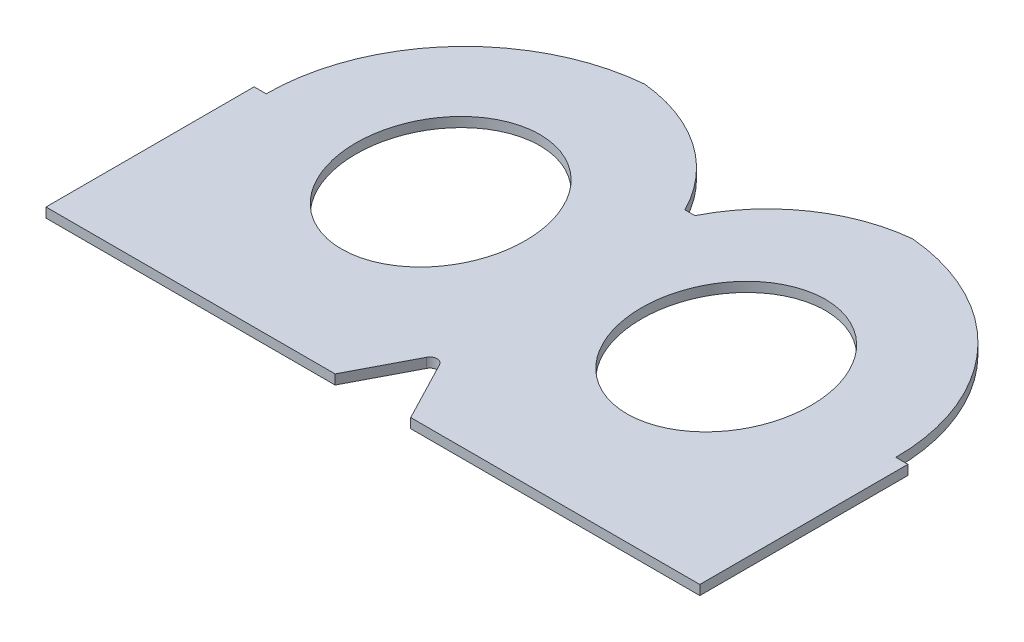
ISO-10303-21;
HEADER;
FILE_DESCRIPTION(('STEP AP214'),'2;1');
FILE_NAME('part.step','',(''),(''),'','','');
FILE_SCHEMA(('AUTOMOTIVE_DESIGN { 1 0 10303 214 1 1 1 1 }'));
ENDSEC;
DATA;
#1=APPLICATION_CONTEXT('core data for automotive mechanical design processes');
#2=APPLICATION_PROTOCOL_DEFINITION('international standard','automotive_design',2000,#1);
#3=PRODUCT_CONTEXT('',#1,'mechanical');
#4=PRODUCT('Part','Part','',(#3));
#5=PRODUCT_RELATED_PRODUCT_CATEGORY('part','',(#4));
#6=PRODUCT_DEFINITION_FORMATION('','',#4);
#7=PRODUCT_DEFINITION_CONTEXT('part definition',#1,'design');
#8=PRODUCT_DEFINITION('design','',#6,#7);
#9=PRODUCT_DEFINITION_SHAPE('','',#8);
#10=(LENGTH_UNIT() NAMED_UNIT(*) SI_UNIT(.MILLI.,.METRE.));
#11=(NAMED_UNIT(*) PLANE_ANGLE_UNIT() SI_UNIT($,.RADIAN.));
#12=(NAMED_UNIT(*) SI_UNIT($,.STERADIAN.) SOLID_ANGLE_UNIT());
#13=UNCERTAINTY_MEASURE_WITH_UNIT(LENGTH_MEASURE(1.E-05),#10,'distance_accuracy_value','');
#14=(GEOMETRIC_REPRESENTATION_CONTEXT(3) GLOBAL_UNCERTAINTY_ASSIGNED_CONTEXT((#13)) GLOBAL_UNIT_ASSIGNED_CONTEXT((#10,
#11,#12)) REPRESENTATION_CONTEXT('',''));
#15=CARTESIAN_POINT('',(0.,0.,0.));
#16=DIRECTION('',(0.,0.,1.));
#17=DIRECTION('',(1.,0.,0.));
#18=AXIS2_PLACEMENT_3D('',#15,#16,#17);
#19=CARTESIAN_POINT('',(0.,2.,0.));
#20=DIRECTION('',(0.,1.,0.));
#21=DIRECTION('',(0.,0.,1.));
#22=AXIS2_PLACEMENT_3D('',#19,#20,#21);
#23=PLANE('',#22);
#24=CARTESIAN_POINT('',(29.5,2.,-64.));
#25=CARTESIAN_POINT('',(29.943372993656,2.,-63.9999962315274));
#26=CARTESIAN_POINT('',(30.3867977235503,2.,-63.9802343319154));
#27=CARTESIAN_POINT('',(31.2703166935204,2.,-63.9014436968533));
#28=CARTESIAN_POINT('',(31.7104092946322,2.,-63.8423967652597));
#29=CARTESIAN_POINT('',(32.5844659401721,2.,-63.6857187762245));
#30=CARTESIAN_POINT('',(33.0184178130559,2.,-63.5880198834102));
#31=CARTESIAN_POINT('',(33.8761494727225,2.,-63.3553893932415));
#32=CARTESIAN_POINT('',(34.2999303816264,2.,-63.2204619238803));
#33=CARTESIAN_POINT('',(35.1328566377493,2.,-62.9157194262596));
#34=CARTESIAN_POINT('',(35.5420525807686,2.,-62.7460423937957));
#35=CARTESIAN_POINT('',(36.3450412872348,2.,-62.3735250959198));
#36=CARTESIAN_POINT('',(36.7388336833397,2.,-62.1706840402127));
#37=CARTESIAN_POINT('',(37.5087460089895,2.,-61.7341745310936));
#38=CARTESIAN_POINT('',(37.884871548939,2.,-61.5005159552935));
#39=CARTESIAN_POINT('',(38.6178518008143,2.,-61.0046835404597));
#40=CARTESIAN_POINT('',(38.9747044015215,2.,-60.742506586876));
#41=CARTESIAN_POINT('',(39.6842195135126,2.,-60.1789401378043));
#42=CARTESIAN_POINT('',(40.0358690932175,2.,-59.8762763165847));
#43=CARTESIAN_POINT('',(40.7151196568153,2.,-59.2451087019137));
#44=CARTESIAN_POINT('',(41.0427200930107,2.,-58.9166043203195));
#45=CARTESIAN_POINT('',(41.6729930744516,2.,-58.2363618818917));
#46=CARTESIAN_POINT('',(41.9756589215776,2.,-57.8846176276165));
#47=CARTESIAN_POINT('',(42.5552806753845,2.,-57.1605450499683));
#48=CARTESIAN_POINT('',(42.8322341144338,2.,-56.7882147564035));
#49=CARTESIAN_POINT('',(43.3969514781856,2.,-55.9718935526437));
#50=CARTESIAN_POINT('',(43.6807832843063,2.,-55.5251762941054));
#51=CARTESIAN_POINT('',(44.2138512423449,2.,-54.6116529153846));
#52=CARTESIAN_POINT('',(44.4630847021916,2.,-54.1448452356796));
#53=CARTESIAN_POINT('',(45.1585970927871,2.,-52.7187507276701));
#54=CARTESIAN_POINT('',(45.552797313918,2.,-51.7336325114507));
#55=CARTESIAN_POINT('',(46.2470008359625,2.,-49.5746076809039));
#56=CARTESIAN_POINT('',(46.5255849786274,2.,-48.3937989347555));
#57=CARTESIAN_POINT('',(46.806267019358,2.,-46.6020956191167));
#58=CARTESIAN_POINT('',(46.876963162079,2.,-46.0010801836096));
#59=CARTESIAN_POINT('',(46.9726748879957,2.,-44.7952752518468));
#60=CARTESIAN_POINT('',(46.9976890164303,2.,-44.1904856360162));
#61=CARTESIAN_POINT('',(47.0022127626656,2.,-42.9227302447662));
#62=CARTESIAN_POINT('',(46.9771288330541,2.,-42.2597470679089));
#63=CARTESIAN_POINT('',(46.8720518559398,2.,-40.9381405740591));
#64=CARTESIAN_POINT('',(46.7920589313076,2.,-40.2795172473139));
#65=CARTESIAN_POINT('',(46.5770113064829,2.,-38.9707048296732));
#66=CARTESIAN_POINT('',(46.4419085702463,2.,-38.3205236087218));
#67=CARTESIAN_POINT('',(46.1166694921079,2.,-37.0344017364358));
#68=CARTESIAN_POINT('',(45.926561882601,2.,-36.3984538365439));
#69=CARTESIAN_POINT('',(45.4905540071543,2.,-35.1435440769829));
#70=CARTESIAN_POINT('',(45.2444703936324,2.,-34.5246457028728));
#71=CARTESIAN_POINT('',(44.6970222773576,2.,-33.3116982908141));
#72=CARTESIAN_POINT('',(44.3956527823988,2.,-32.7176515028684));
#73=CARTESIAN_POINT('',(43.7384474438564,2.,-31.5613383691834));
#74=CARTESIAN_POINT('',(43.3826880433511,2.,-30.9990289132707));
#75=CARTESIAN_POINT('',(42.8089602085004,2.,-30.1842028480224));
#76=CARTESIAN_POINT('',(42.6110526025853,2.,-29.9173862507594));
#77=CARTESIAN_POINT('',(42.2019461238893,2.,-29.3940193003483));
#78=CARTESIAN_POINT('',(41.9907440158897,2.,-29.1374714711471));
#79=CARTESIAN_POINT('',(41.4493678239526,2.,-28.5135558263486));
#80=CARTESIAN_POINT('',(41.1112951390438,2.,-28.1529839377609));
#81=CARTESIAN_POINT('',(40.40749549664,2.,-27.4600729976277));
#82=CARTESIAN_POINT('',(40.0417736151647,2.,-27.127728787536));
#83=CARTESIAN_POINT('',(39.2838979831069,2.,-26.494427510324));
#84=CARTESIAN_POINT('',(38.8917423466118,2.,-26.1934726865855));
#85=CARTESIAN_POINT('',(38.2853046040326,2.,-25.7682711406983));
#86=CARTESIAN_POINT('',(38.0801193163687,2.,-25.6309059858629));
#87=CARTESIAN_POINT('',(37.6638444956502,2.,-25.3652473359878));
#88=CARTESIAN_POINT('',(37.4527526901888,2.,-25.2369574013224));
#89=CARTESIAN_POINT('',(36.808255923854,2.,-24.8647178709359));
#90=CARTESIAN_POINT('',(36.3663337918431,2.,-24.6353014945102));
#91=CARTESIAN_POINT('',(35.4631139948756,2.,-24.218457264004));
#92=CARTESIAN_POINT('',(35.0018188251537,2.,-24.0310240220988));
#93=CARTESIAN_POINT('',(34.2986743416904,2.,-23.7836860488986));
#94=CARTESIAN_POINT('',(34.0626441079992,2.,-23.7069294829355));
#95=CARTESIAN_POINT('',(33.5872031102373,2.,-23.564883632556));
#96=CARTESIAN_POINT('',(33.3477932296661,2.,-23.4995914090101));
#97=CARTESIAN_POINT('',(32.8661993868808,2.,-23.3807618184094));
#98=CARTESIAN_POINT('',(32.6240168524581,2.,-23.3272186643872));
#99=CARTESIAN_POINT('',(32.1373265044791,2.,-23.2320720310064));
#100=CARTESIAN_POINT('',(31.8928186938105,2.,-23.1904685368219));
#101=CARTESIAN_POINT('',(31.2920002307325,2.,-23.1034498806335));
#102=CARTESIAN_POINT('',(30.9347024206,2.,-23.0646854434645));
#103=CARTESIAN_POINT('',(30.2182810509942,2.,-23.012959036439));
#104=CARTESIAN_POINT('',(29.8591574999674,2.,-22.9999969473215));
#105=CARTESIAN_POINT('',(29.0566270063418,2.,-23.0000037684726));
#106=CARTESIAN_POINT('',(28.6132022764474,2.,-23.0197656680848));
#107=CARTESIAN_POINT('',(27.7296833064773,2.,-23.098556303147));
#108=CARTESIAN_POINT('',(27.2895907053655,2.,-23.1576032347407));
#109=CARTESIAN_POINT('',(26.4155340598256,2.,-23.314281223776));
#110=CARTESIAN_POINT('',(25.9815821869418,2.,-23.4119801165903));
#111=CARTESIAN_POINT('',(25.1238505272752,2.,-23.6446106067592));
#112=CARTESIAN_POINT('',(24.7000696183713,2.,-23.7795380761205));
#113=CARTESIAN_POINT('',(23.8671433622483,2.,-24.0842805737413));
#114=CARTESIAN_POINT('',(23.4579474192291,2.,-24.2539576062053));
#115=CARTESIAN_POINT('',(22.654958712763,2.,-24.6264749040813));
#116=CARTESIAN_POINT('',(22.2611663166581,2.,-24.8293159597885));
#117=CARTESIAN_POINT('',(21.4912539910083,2.,-25.2658254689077));
#118=CARTESIAN_POINT('',(21.1151284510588,2.,-25.4994840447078));
#119=CARTESIAN_POINT('',(20.3821481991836,2.,-25.9953164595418));
#120=CARTESIAN_POINT('',(20.0252955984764,2.,-26.2574934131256));
#121=CARTESIAN_POINT('',(19.3157804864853,2.,-26.8210598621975));
#122=CARTESIAN_POINT('',(18.9641309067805,2.,-27.1237236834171));
#123=CARTESIAN_POINT('',(18.2848803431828,2.,-27.7548912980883));
#124=CARTESIAN_POINT('',(17.9572799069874,2.,-28.0833956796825));
#125=CARTESIAN_POINT('',(17.3270069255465,2.,-28.7636381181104));
#126=CARTESIAN_POINT('',(17.0243410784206,2.,-29.1153823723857));
#127=CARTESIAN_POINT('',(16.4447193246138,2.,-29.839454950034));
#128=CARTESIAN_POINT('',(16.1677658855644,2.,-30.2117852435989));
#129=CARTESIAN_POINT('',(15.6030485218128,2.,-31.0281064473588));
#130=CARTESIAN_POINT('',(15.3192167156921,2.,-31.4748237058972));
#131=CARTESIAN_POINT('',(14.7861487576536,2.,-32.3883470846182));
#132=CARTESIAN_POINT('',(14.5369152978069,2.,-32.8551547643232));
#133=CARTESIAN_POINT('',(13.8414029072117,2.,-34.2812492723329));
#134=CARTESIAN_POINT('',(13.4472026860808,2.,-35.2663674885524));
#135=CARTESIAN_POINT('',(12.7529991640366,2.,-37.4253923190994));
#136=CARTESIAN_POINT('',(12.4744150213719,2.,-38.606201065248));
#137=CARTESIAN_POINT('',(12.1937329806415,2.,-40.3979043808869));
#138=CARTESIAN_POINT('',(12.1230368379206,2.,-40.9989198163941));
#139=CARTESIAN_POINT('',(12.0273251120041,2.,-42.204724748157));
#140=CARTESIAN_POINT('',(12.0023109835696,2.,-42.8095143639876));
#141=CARTESIAN_POINT('',(11.9977872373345,2.,-44.0772697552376));
#142=CARTESIAN_POINT('',(12.0228711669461,2.,-44.7402529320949));
#143=CARTESIAN_POINT('',(12.1279481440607,2.,-46.0618594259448));
#144=CARTESIAN_POINT('',(12.207941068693,2.,-46.72048275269));
#145=CARTESIAN_POINT('',(12.4229886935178,2.,-48.0292951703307));
#146=CARTESIAN_POINT('',(12.5580914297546,2.,-48.6794763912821));
#147=CARTESIAN_POINT('',(12.8833305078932,2.,-49.9655982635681));
#148=CARTESIAN_POINT('',(13.0734381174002,2.,-50.60154616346));
#149=CARTESIAN_POINT('',(13.5094459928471,2.,-51.8564559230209));
#150=CARTESIAN_POINT('',(13.7555296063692,2.,-52.4753542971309));
#151=CARTESIAN_POINT('',(14.3029777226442,2.,-53.6883017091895));
#152=CARTESIAN_POINT('',(14.6043472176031,2.,-54.2823484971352));
#153=CARTESIAN_POINT('',(15.2615525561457,2.,-55.43866163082));
#154=CARTESIAN_POINT('',(15.6173119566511,2.,-56.0009710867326));
#155=CARTESIAN_POINT('',(16.1910397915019,2.,-56.8157971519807));
#156=CARTESIAN_POINT('',(16.388947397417,2.,-57.0826137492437));
#157=CARTESIAN_POINT('',(16.7980538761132,2.,-57.6059806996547));
#158=CARTESIAN_POINT('',(17.0092559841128,2.,-57.8625285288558));
#159=CARTESIAN_POINT('',(17.55063217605,2.,-58.4864441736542));
#160=CARTESIAN_POINT('',(17.8887048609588,2.,-58.8470160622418));
#161=CARTESIAN_POINT('',(18.5925045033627,2.,-59.5399270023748));
#162=CARTESIAN_POINT('',(18.9582263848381,2.,-59.8722712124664));
#163=CARTESIAN_POINT('',(19.7161020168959,2.,-60.5055724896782));
#164=CARTESIAN_POINT('',(20.1082576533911,2.,-60.8065273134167));
#165=CARTESIAN_POINT('',(20.7146953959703,2.,-61.2317288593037));
#166=CARTESIAN_POINT('',(20.9198806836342,2.,-61.369094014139));
#167=CARTESIAN_POINT('',(21.3361555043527,2.,-61.634752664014));
#168=CARTESIAN_POINT('',(21.5472473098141,2.,-61.7630425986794));
#169=CARTESIAN_POINT('',(22.1917440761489,2.,-62.1352821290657));
#170=CARTESIAN_POINT('',(22.6336662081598,2.,-62.3646985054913));
#171=CARTESIAN_POINT('',(23.5368860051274,2.,-62.7815427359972));
#172=CARTESIAN_POINT('',(23.9981811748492,2.,-62.9689759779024));
#173=CARTESIAN_POINT('',(24.7013256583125,2.,-63.2163139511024));
#174=CARTESIAN_POINT('',(24.9373558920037,2.,-63.2930705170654));
#175=CARTESIAN_POINT('',(25.4127968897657,2.,-63.4351163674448));
#176=CARTESIAN_POINT('',(25.6522067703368,2.,-63.5004085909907));
#177=CARTESIAN_POINT('',(26.1338006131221,2.,-63.6192381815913));
#178=CARTESIAN_POINT('',(26.3759831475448,2.,-63.6727813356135));
#179=CARTESIAN_POINT('',(26.8626734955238,2.,-63.7679279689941));
#180=CARTESIAN_POINT('',(27.1071813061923,2.,-63.8095314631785));
#181=CARTESIAN_POINT('',(27.7079997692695,2.,-63.8965501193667));
#182=CARTESIAN_POINT('',(28.0652975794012,2.,-63.9353145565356));
#183=CARTESIAN_POINT('',(28.7817189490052,2.,-63.987040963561));
#184=CARTESIAN_POINT('',(29.1408425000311,2.,-64.0000030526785));
#185=CARTESIAN_POINT('',(29.5,2.,-64.));
#186=B_SPLINE_CURVE_WITH_KNOTS('',3,(#24,#25,#26,#27,#28,#29,#30,#31,#32,#33,#34,#35,#36,#37,
#38,#39,#40,#41,#42,#43,#44,#45,#46,#47,#48,#49,#50,#51,#52,#53,#54,#55,#56,#57,#58,#59,#60,#61,
#62,#63,#64,#65,#66,#67,#68,#69,#70,#71,#72,#73,#74,#75,#76,#77,#78,#79,#80,#81,#82,#83,#84,#85,
#86,#87,#88,#89,#90,#91,#92,#93,#94,#95,#96,#97,#98,#99,#100,#101,#102,#103,#104,#105,#106,#107,
#108,#109,#110,#111,#112,#113,#114,#115,#116,#117,#118,#119,#120,#121,#122,#123,#124,#125,#126,
#127,#128,#129,#130,#131,#132,#133,#134,#135,#136,#137,#138,#139,#140,#141,#142,#143,#144,#145,
#146,#147,#148,#149,#150,#151,#152,#153,#154,#155,#156,#157,#158,#159,#160,#161,#162,#163,#164,
#165,#166,#167,#168,#169,#170,#171,#172,#173,#174,#175,#176,#177,#178,#179,#180,#181,#182,#183,
#184,#185),.UNSPECIFIED.,.T.,.F.,(4,2,2,2,2,2,2,2,2,2,2,2,2,2,2,2,2,2,2,2,2,2,2,2,2,2,2,2,2,2,2,
2,2,2,2,2,2,2,2,2,2,2,2,2,2,2,2,2,2,2,2,2,2,2,2,2,2,2,2,2,2,2,2,2,2,2,2,2,2,2,2,2,2,2,2,2,2,2,2,
2,4),(0.,1.32977112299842,2.66015860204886,3.99289138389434,5.3254764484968,6.65286880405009,
7.9802927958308,9.30729235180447,10.6344369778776,12.024925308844,13.415445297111,
14.8063376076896,16.197363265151,17.7834927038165,19.3697454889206,22.541675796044,
26.1654736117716,27.9795459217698,29.7936760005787,31.781767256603,33.7698540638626,
35.759677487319,37.7484633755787,39.7438597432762,41.7394363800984,43.7322336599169,
44.7284818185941,45.7249733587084,47.206182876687,48.6871211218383,50.1681651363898,
50.9087239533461,51.6495717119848,53.1411513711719,54.6325395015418,55.3768902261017,
56.1210498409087,56.864842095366,57.6086334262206,58.6858291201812,59.7630198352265,
61.092790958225,62.4231784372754,63.755911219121,65.0884962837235,66.4158886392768,
67.7433126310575,69.0703121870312,70.3974568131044,71.7879451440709,73.178465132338,
74.5693574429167,75.9603831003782,77.5465125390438,79.132765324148,82.3046956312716,
85.9284934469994,87.7425657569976,89.5566958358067,91.5447870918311,93.5328738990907,
95.5226973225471,97.5114832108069,99.5068795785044,101.502456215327,103.495253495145,
104.491501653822,105.487993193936,106.969202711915,108.450140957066,109.931184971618,
110.671743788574,111.412591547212,112.904171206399,114.395559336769,115.139910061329,
115.884069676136,116.627861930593,117.371653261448,118.448848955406,119.526039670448),.UNSPECIFIED.);
#187=CARTESIAN_POINT('',(29.5,2.,-64.));
#188=VERTEX_POINT('',#187);
#189=EDGE_CURVE('E260',#188,#188,#186,.T.);
#190=ORIENTED_EDGE('',*,*,#189,.T.);
#191=EDGE_LOOP('',(#190));
#192=FACE_BOUND('',#191,.T.);
#193=CARTESIAN_POINT('',(-29.5,2.,-64.));
#194=CARTESIAN_POINT('',(-29.056627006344,2.,-63.9999962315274));
#195=CARTESIAN_POINT('',(-28.6132022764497,2.,-63.9802343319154));
#196=CARTESIAN_POINT('',(-27.7296833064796,2.,-63.9014436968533));
#197=CARTESIAN_POINT('',(-27.2895907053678,2.,-63.8423967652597));
#198=CARTESIAN_POINT('',(-26.4155340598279,2.,-63.6857187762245));
#199=CARTESIAN_POINT('',(-25.9815821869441,2.,-63.5880198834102));
#200=CARTESIAN_POINT('',(-25.1238505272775,2.,-63.3553893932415));
#201=CARTESIAN_POINT('',(-24.7000696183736,2.,-63.2204619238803));
#202=CARTESIAN_POINT('',(-23.8671433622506,2.,-62.9157194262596));
#203=CARTESIAN_POINT('',(-23.4579474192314,2.,-62.7460423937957));
#204=CARTESIAN_POINT('',(-22.6549587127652,2.,-62.3735250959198));
#205=CARTESIAN_POINT('',(-22.2611663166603,2.,-62.1706840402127));
#206=CARTESIAN_POINT('',(-21.4912539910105,2.,-61.7341745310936));
#207=CARTESIAN_POINT('',(-21.115128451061,2.,-61.5005159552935));
#208=CARTESIAN_POINT('',(-20.3821481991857,2.,-61.0046835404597));
#209=CARTESIAN_POINT('',(-20.0252955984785,2.,-60.742506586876));
#210=CARTESIAN_POINT('',(-19.3157804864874,2.,-60.1789401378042));
#211=CARTESIAN_POINT('',(-18.9641309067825,2.,-59.8762763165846));
#212=CARTESIAN_POINT('',(-18.2848803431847,2.,-59.2451087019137));
#213=CARTESIAN_POINT('',(-17.9572799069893,2.,-58.9166043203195));
#214=CARTESIAN_POINT('',(-17.3270069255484,2.,-58.2363618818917));
#215=CARTESIAN_POINT('',(-17.0243410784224,2.,-57.8846176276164));
#216=CARTESIAN_POINT('',(-16.4447193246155,2.,-57.1605450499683));
#217=CARTESIAN_POINT('',(-16.1677658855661,2.,-56.7882147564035));
#218=CARTESIAN_POINT('',(-15.6030485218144,2.,-55.9718935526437));
#219=CARTESIAN_POINT('',(-15.3192167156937,2.,-55.5251762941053));
#220=CARTESIAN_POINT('',(-14.7861487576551,2.,-54.6116529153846));
#221=CARTESIAN_POINT('',(-14.5369152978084,2.,-54.1448452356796));
#222=CARTESIAN_POINT('',(-13.8414029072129,2.,-52.7187507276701));
#223=CARTESIAN_POINT('',(-13.447202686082,2.,-51.7336325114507));
#224=CARTESIAN_POINT('',(-12.7529991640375,2.,-49.5746076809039));
#225=CARTESIAN_POINT('',(-12.4744150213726,2.,-48.3937989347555));
#226=CARTESIAN_POINT('',(-12.193732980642,2.,-46.6020956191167));
#227=CARTESIAN_POINT('',(-12.123036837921,2.,-46.0010801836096));
#228=CARTESIAN_POINT('',(-12.0273251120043,2.,-44.7952752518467));
#229=CARTESIAN_POINT('',(-12.0023109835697,2.,-44.1904856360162));
#230=CARTESIAN_POINT('',(-11.9977872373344,2.,-42.9227302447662));
#231=CARTESIAN_POINT('',(-12.0228711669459,2.,-42.2597470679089));
#232=CARTESIAN_POINT('',(-12.1279481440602,2.,-40.9381405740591));
#233=CARTESIAN_POINT('',(-12.2079410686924,2.,-40.2795172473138));
#234=CARTESIAN_POINT('',(-12.4229886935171,2.,-38.9707048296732));
#235=CARTESIAN_POINT('',(-12.5580914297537,2.,-38.3205236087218));
#236=CARTESIAN_POINT('',(-12.8833305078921,2.,-37.0344017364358));
#237=CARTESIAN_POINT('',(-13.073438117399,2.,-36.3984538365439));
#238=CARTESIAN_POINT('',(-13.5094459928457,2.,-35.1435440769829));
#239=CARTESIAN_POINT('',(-13.7555296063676,2.,-34.5246457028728));
#240=CARTESIAN_POINT('',(-14.3029777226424,2.,-33.3116982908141));
#241=CARTESIAN_POINT('',(-14.6043472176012,2.,-32.7176515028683));
#242=CARTESIAN_POINT('',(-15.2615525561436,2.,-31.5613383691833));
#243=CARTESIAN_POINT('',(-15.6173119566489,2.,-30.9990289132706));
#244=CARTESIAN_POINT('',(-16.1910397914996,2.,-30.1842028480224));
#245=CARTESIAN_POINT('',(-16.3889473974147,2.,-29.9173862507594));
#246=CARTESIAN_POINT('',(-16.7980538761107,2.,-29.3940193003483));
#247=CARTESIAN_POINT('',(-17.0092559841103,2.,-29.1374714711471));
#248=CARTESIAN_POINT('',(-17.5506321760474,2.,-28.5135558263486));
#249=CARTESIAN_POINT('',(-17.8887048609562,2.,-28.1529839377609));
#250=CARTESIAN_POINT('',(-18.5925045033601,2.,-27.4600729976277));
#251=CARTESIAN_POINT('',(-18.9582263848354,2.,-27.127728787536));
#252=CARTESIAN_POINT('',(-19.7161020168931,2.,-26.494427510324));
#253=CARTESIAN_POINT('',(-20.1082576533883,2.,-26.1934726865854));
#254=CARTESIAN_POINT('',(-20.7146953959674,2.,-25.7682711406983));
#255=CARTESIAN_POINT('',(-20.9198806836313,2.,-25.6309059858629));
#256=CARTESIAN_POINT('',(-21.3361555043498,2.,-25.3652473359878));
#257=CARTESIAN_POINT('',(-21.5472473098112,2.,-25.2369574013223));
#258=CARTESIAN_POINT('',(-22.191744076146,2.,-24.8647178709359));
#259=CARTESIAN_POINT('',(-22.6336662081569,2.,-24.6353014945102));
#260=CARTESIAN_POINT('',(-23.5368860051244,2.,-24.218457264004));
#261=CARTESIAN_POINT('',(-23.9981811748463,2.,-24.0310240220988));
#262=CARTESIAN_POINT('',(-24.7013256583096,2.,-23.7836860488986));
#263=CARTESIAN_POINT('',(-24.9373558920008,2.,-23.7069294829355));
#264=CARTESIAN_POINT('',(-25.4127968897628,2.,-23.564883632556));
#265=CARTESIAN_POINT('',(-25.6522067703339,2.,-23.4995914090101));
#266=CARTESIAN_POINT('',(-26.1338006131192,2.,-23.3807618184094));
#267=CARTESIAN_POINT('',(-26.3759831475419,2.,-23.3272186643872));
#268=CARTESIAN_POINT('',(-26.862673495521,2.,-23.2320720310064));
#269=CARTESIAN_POINT('',(-27.1071813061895,2.,-23.1904685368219));
#270=CARTESIAN_POINT('',(-27.7079997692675,2.,-23.1034498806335));
#271=CARTESIAN_POINT('',(-28.0652975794,2.,-23.0646854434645));
#272=CARTESIAN_POINT('',(-28.7817189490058,2.,-23.012959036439));
#273=CARTESIAN_POINT('',(-29.1408425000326,2.,-22.9999969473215));
#274=CARTESIAN_POINT('',(-29.9433729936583,2.,-23.0000037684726));
#275=CARTESIAN_POINT('',(-30.3867977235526,2.,-23.0197656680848));
#276=CARTESIAN_POINT('',(-31.2703166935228,2.,-23.098556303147));
#277=CARTESIAN_POINT('',(-31.7104092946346,2.,-23.1576032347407));
#278=CARTESIAN_POINT('',(-32.5844659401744,2.,-23.314281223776));
#279=CARTESIAN_POINT('',(-33.0184178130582,2.,-23.4119801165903));
#280=CARTESIAN_POINT('',(-33.8761494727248,2.,-23.6446106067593));
#281=CARTESIAN_POINT('',(-34.2999303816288,2.,-23.7795380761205));
#282=CARTESIAN_POINT('',(-35.1328566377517,2.,-24.0842805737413));
#283=CARTESIAN_POINT('',(-35.5420525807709,2.,-24.2539576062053));
#284=CARTESIAN_POINT('',(-36.345041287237,2.,-24.6264749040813));
#285=CARTESIAN_POINT('',(-36.7388336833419,2.,-24.8293159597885));
#286=CARTESIAN_POINT('',(-37.5087460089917,2.,-25.2658254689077));
#287=CARTESIAN_POINT('',(-37.8848715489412,2.,-25.4994840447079));
#288=CARTESIAN_POINT('',(-38.6178518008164,2.,-25.9953164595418));
#289=CARTESIAN_POINT('',(-38.9747044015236,2.,-26.2574934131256));
#290=CARTESIAN_POINT('',(-39.6842195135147,2.,-26.8210598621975));
#291=CARTESIAN_POINT('',(-40.0358690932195,2.,-27.1237236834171));
#292=CARTESIAN_POINT('',(-40.7151196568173,2.,-27.7548912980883));
#293=CARTESIAN_POINT('',(-41.0427200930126,2.,-28.0833956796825));
#294=CARTESIAN_POINT('',(-41.6729930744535,2.,-28.7636381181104));
#295=CARTESIAN_POINT('',(-41.9756589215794,2.,-29.1153823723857));
#296=CARTESIAN_POINT('',(-42.5552806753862,2.,-29.839454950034));
#297=CARTESIAN_POINT('',(-42.8322341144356,2.,-30.2117852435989));
#298=CARTESIAN_POINT('',(-43.3969514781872,2.,-31.0281064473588));
#299=CARTESIAN_POINT('',(-43.6807832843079,2.,-31.4748237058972));
#300=CARTESIAN_POINT('',(-44.2138512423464,2.,-32.3883470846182));
#301=CARTESIAN_POINT('',(-44.4630847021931,2.,-32.8551547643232));
#302=CARTESIAN_POINT('',(-45.1585970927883,2.,-34.2812492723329));
#303=CARTESIAN_POINT('',(-45.5527973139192,2.,-35.2663674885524));
#304=CARTESIAN_POINT('',(-46.2470008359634,2.,-37.4253923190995));
#305=CARTESIAN_POINT('',(-46.5255849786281,2.,-38.606201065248));
#306=CARTESIAN_POINT('',(-46.8062670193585,2.,-40.3979043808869));
#307=CARTESIAN_POINT('',(-46.8769631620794,2.,-40.9989198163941));
#308=CARTESIAN_POINT('',(-46.9726748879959,2.,-42.204724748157));
#309=CARTESIAN_POINT('',(-46.9976890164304,2.,-42.8095143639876));
#310=CARTESIAN_POINT('',(-47.0022127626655,2.,-44.0772697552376));
#311=CARTESIAN_POINT('',(-46.9771288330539,2.,-44.7402529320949));
#312=CARTESIAN_POINT('',(-46.8720518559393,2.,-46.0618594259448));
#313=CARTESIAN_POINT('',(-46.792058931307,2.,-46.72048275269));
#314=CARTESIAN_POINT('',(-46.5770113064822,2.,-48.0292951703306));
#315=CARTESIAN_POINT('',(-46.4419085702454,2.,-48.679476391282));
#316=CARTESIAN_POINT('',(-46.1166694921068,2.,-49.965598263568));
#317=CARTESIAN_POINT('',(-45.9265618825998,2.,-50.6015461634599));
#318=CARTESIAN_POINT('',(-45.4905540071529,2.,-51.8564559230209));
#319=CARTESIAN_POINT('',(-45.2444703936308,2.,-52.4753542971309));
#320=CARTESIAN_POINT('',(-44.6970222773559,2.,-53.6883017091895));
#321=CARTESIAN_POINT('',(-44.3956527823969,2.,-54.2823484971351));
#322=CARTESIAN_POINT('',(-43.7384474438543,2.,-55.43866163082));
#323=CARTESIAN_POINT('',(-43.3826880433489,2.,-56.0009710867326));
#324=CARTESIAN_POINT('',(-42.8089602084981,2.,-56.8157971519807));
#325=CARTESIAN_POINT('',(-42.611052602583,2.,-57.0826137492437));
#326=CARTESIAN_POINT('',(-42.2019461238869,2.,-57.6059806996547));
#327=CARTESIAN_POINT('',(-41.9907440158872,2.,-57.8625285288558));
#328=CARTESIAN_POINT('',(-41.44936782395,2.,-58.4864441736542));
#329=CARTESIAN_POINT('',(-41.1112951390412,2.,-58.8470160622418));
#330=CARTESIAN_POINT('',(-40.4074954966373,2.,-59.5399270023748));
#331=CARTESIAN_POINT('',(-40.0417736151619,2.,-59.8722712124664));
#332=CARTESIAN_POINT('',(-39.2838979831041,2.,-60.5055724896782));
#333=CARTESIAN_POINT('',(-38.891742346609,2.,-60.8065273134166));
#334=CARTESIAN_POINT('',(-38.2853046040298,2.,-61.2317288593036));
#335=CARTESIAN_POINT('',(-38.0801193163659,2.,-61.3690940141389));
#336=CARTESIAN_POINT('',(-37.6638444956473,2.,-61.6347526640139));
#337=CARTESIAN_POINT('',(-37.4527526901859,2.,-61.7630425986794));
#338=CARTESIAN_POINT('',(-36.8082559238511,2.,-62.1352821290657));
#339=CARTESIAN_POINT('',(-36.3663337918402,2.,-62.3646985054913));
#340=CARTESIAN_POINT('',(-35.4631139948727,2.,-62.7815427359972));
#341=CARTESIAN_POINT('',(-35.0018188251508,2.,-62.9689759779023));
#342=CARTESIAN_POINT('',(-34.2986743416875,2.,-63.2163139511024));
#343=CARTESIAN_POINT('',(-34.0626441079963,2.,-63.2930705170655));
#344=CARTESIAN_POINT('',(-33.5872031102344,2.,-63.4351163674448));
#345=CARTESIAN_POINT('',(-33.3477932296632,2.,-63.5004085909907));
#346=CARTESIAN_POINT('',(-32.866199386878,2.,-63.6192381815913));
#347=CARTESIAN_POINT('',(-32.6240168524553,2.,-63.6727813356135));
#348=CARTESIAN_POINT('',(-32.1373265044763,2.,-63.7679279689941));
#349=CARTESIAN_POINT('',(-31.8928186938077,2.,-63.8095314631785));
#350=CARTESIAN_POINT('',(-31.2920002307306,2.,-63.8965501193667));
#351=CARTESIAN_POINT('',(-30.9347024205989,2.,-63.9353145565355));
#352=CARTESIAN_POINT('',(-30.2182810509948,2.,-63.987040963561));
#353=CARTESIAN_POINT('',(-29.8591574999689,2.,-64.0000030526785));
#354=CARTESIAN_POINT('',(-29.5,2.,-64.));
#355=B_SPLINE_CURVE_WITH_KNOTS('',3,(#193,#194,#195,#196,#197,#198,#199,#200,#201,#202,#203,
#204,#205,#206,#207,#208,#209,#210,#211,#212,#213,#214,#215,#216,#217,#218,#219,#220,#221,#222,
#223,#224,#225,#226,#227,#228,#229,#230,#231,#232,#233,#234,#235,#236,#237,#238,#239,#240,#241,
#242,#243,#244,#245,#246,#247,#248,#249,#250,#251,#252,#253,#254,#255,#256,#257,#258,#259,#260,
#261,#262,#263,#264,#265,#266,#267,#268,#269,#270,#271,#272,#273,#274,#275,#276,#277,#278,#279,
#280,#281,#282,#283,#284,#285,#286,#287,#288,#289,#290,#291,#292,#293,#294,#295,#296,#297,#298,
#299,#300,#301,#302,#303,#304,#305,#306,#307,#308,#309,#310,#311,#312,#313,#314,#315,#316,#317,
#318,#319,#320,#321,#322,#323,#324,#325,#326,#327,#328,#329,#330,#331,#332,#333,#334,#335,#336,
#337,#338,#339,#340,#341,#342,#343,#344,#345,#346,#347,#348,#349,#350,#351,#352,#353,#354),
.UNSPECIFIED.,.T.,.F.,(4,2,2,2,2,2,2,2,2,2,2,2,2,2,2,2,2,2,2,2,2,2,2,2,2,2,2,2,2,2,2,2,2,2,2,2,
2,2,2,2,2,2,2,2,2,2,2,2,2,2,2,2,2,2,2,2,2,2,2,2,2,2,2,2,2,2,2,2,2,2,2,2,2,2,2,2,2,2,2,2,4),(0.,
1.32977112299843,2.66015860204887,3.99289138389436,5.32547644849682,6.65286880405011,
7.98029279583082,9.30729235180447,10.6344369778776,12.024925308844,13.415445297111,
14.8063376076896,16.197363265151,17.7834927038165,19.3697454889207,22.541675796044,
26.1654736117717,27.9795459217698,29.7936760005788,31.781767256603,33.7698540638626,
35.759677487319,37.7484633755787,39.7438597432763,41.7394363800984,43.7322336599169,
44.7284818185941,45.7249733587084,47.2061828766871,48.6871211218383,50.1681651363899,
50.9087239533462,51.6495717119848,53.1411513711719,54.6325395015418,55.3768902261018,
56.1210498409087,56.8648420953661,57.6086334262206,58.6858291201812,59.7630198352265,
61.092790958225,62.4231784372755,63.755911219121,65.0884962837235,66.4158886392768,
67.7433126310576,69.0703121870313,70.3974568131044,71.7879451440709,73.1784651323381,
74.5693574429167,75.9603831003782,77.5465125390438,79.132765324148,82.3046956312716,
85.9284934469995,87.7425657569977,89.5566958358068,91.5447870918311,93.5328738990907,
95.5226973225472,97.511483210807,99.5068795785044,101.502456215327,103.495253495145,
104.491501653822,105.487993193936,106.969202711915,108.450140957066,109.931184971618,
110.671743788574,111.412591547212,112.904171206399,114.395559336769,115.139910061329,
115.884069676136,116.627861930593,117.371653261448,118.448848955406,119.526039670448),.UNSPECIFIED.);
#356=CARTESIAN_POINT('',(-29.5,2.,-64.));
#357=VERTEX_POINT('',#356);
#358=EDGE_CURVE('E173',#357,#357,#355,.T.);
#359=ORIENTED_EDGE('',*,*,#358,.T.);
#360=EDGE_LOOP('',(#359));
#361=FACE_BOUND('',#360,.T.);
#362=CARTESIAN_POINT('',(0.,2.,-11.7514791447));
#363=DIRECTION('',(0.,-1.,0.));
#364=DIRECTION('',(0.,0.,-1.));
#365=AXIS2_PLACEMENT_3D('',#362,#363,#364);
#366=CIRCLE('',#365,1.5);
#367=CARTESIAN_POINT('',(-1.33051624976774,2.,-12.4441020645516));
#368=VERTEX_POINT('',#367);
#369=CARTESIAN_POINT('',(1.3305162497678,2.,-12.4441020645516));
#370=VERTEX_POINT('',#369);
#371=EDGE_CURVE('E20',#368,#370,#366,.T.);
#372=ORIENTED_EDGE('',*,*,#371,.T.);
#373=DIRECTION('',(-0.461748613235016,0.,-0.887010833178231));
#374=VECTOR('',#373,1.);
#375=CARTESIAN_POINT('',(7.808505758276,2.,0.));
#376=LINE('',#375,#374);
#377=CARTESIAN_POINT('',(7.808505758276,2.,0.));
#378=VERTEX_POINT('',#377);
#379=EDGE_CURVE('E120',#370,#378,#376,.F.);
#380=ORIENTED_EDGE('',*,*,#379,.T.);
#381=DIRECTION('',(1.,0.,0.));
#382=VECTOR('',#381,1.);
#383=CARTESIAN_POINT('',(-67.55,2.,0.));
#384=LINE('',#383,#382);
#385=CARTESIAN_POINT('',(67.55,2.,0.));
#386=VERTEX_POINT('',#385);
#387=EDGE_CURVE('E132',#386,#378,#384,.F.);
#388=ORIENTED_EDGE('',*,*,#387,.F.);
#389=DIRECTION('',(0.,0.,-1.));
#390=VECTOR('',#389,1.);
#391=CARTESIAN_POINT('',(67.55,2.,0.));
#392=LINE('',#391,#390);
#393=CARTESIAN_POINT('',(67.55,2.,-43.));
#394=VERTEX_POINT('',#393);
#395=EDGE_CURVE('E186',#394,#386,#392,.F.);
#396=ORIENTED_EDGE('',*,*,#395,.F.);
#397=DIRECTION('',(-1.,0.,0.));
#398=VECTOR('',#397,1.);
#399=CARTESIAN_POINT('',(67.55,2.,-43.));
#400=LINE('',#399,#398);
#401=CARTESIAN_POINT('',(65.05,2.,-43.));
#402=VERTEX_POINT('',#401);
#403=EDGE_CURVE('E180',#402,#394,#400,.F.);
#404=ORIENTED_EDGE('',*,*,#403,.F.);
#405=CARTESIAN_POINT('',(24.05,2.,-43.));
#406=DIRECTION('',(0.,1.,0.));
#407=DIRECTION('',(0.,0.,1.));
#408=AXIS2_PLACEMENT_3D('',#405,#406,#407);
#409=CIRCLE('',#408,41.);
#410=CARTESIAN_POINT('',(27.7007477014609,2.,-83.8371404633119));
#411=VERTEX_POINT('',#410);
#412=EDGE_CURVE('E299',#411,#402,#409,.F.);
#413=ORIENTED_EDGE('',*,*,#412,.F.);
#414=CARTESIAN_POINT('',(31.,2.,-50.5));
#415=DIRECTION('',(0.,1.,0.));
#416=DIRECTION('',(0.,0.,1.));
#417=AXIS2_PLACEMENT_3D('',#414,#415,#416);
#418=CIRCLE('',#417,33.5);
#419=CARTESIAN_POINT('',(1.04586839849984,2.,-65.5));
#420=VERTEX_POINT('',#419);
#421=EDGE_CURVE('E297',#420,#411,#418,.F.);
#422=ORIENTED_EDGE('',*,*,#421,.F.);
#423=DIRECTION('',(-1.,0.,0.));
#424=VECTOR('',#423,1.);
#425=CARTESIAN_POINT('',(1.0458683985,2.,-65.5));
#426=LINE('',#425,#424);
#427=CARTESIAN_POINT('',(-1.04586839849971,2.,-65.5000000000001));
#428=VERTEX_POINT('',#427);
#429=EDGE_CURVE('E176',#428,#420,#426,.F.);
#430=ORIENTED_EDGE('',*,*,#429,.F.);
#431=CARTESIAN_POINT('',(-31.,2.,-50.5));
#432=DIRECTION('',(0.,1.,0.));
#433=DIRECTION('',(0.,0.,1.));
#434=AXIS2_PLACEMENT_3D('',#431,#432,#433);
#435=CIRCLE('',#434,33.5);
#436=CARTESIAN_POINT('',(-27.7007477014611,2.,-83.837140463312));
#437=VERTEX_POINT('',#436);
#438=EDGE_CURVE('E295',#437,#428,#435,.F.);
#439=ORIENTED_EDGE('',*,*,#438,.F.);
#440=CARTESIAN_POINT('',(-24.05,2.,-43.));
#441=DIRECTION('',(0.,1.,0.));
#442=DIRECTION('',(0.,0.,1.));
#443=AXIS2_PLACEMENT_3D('',#440,#441,#442);
#444=CIRCLE('',#443,41.);
#445=CARTESIAN_POINT('',(-65.05,2.,-43.));
#446=VERTEX_POINT('',#445);
#447=EDGE_CURVE('E292',#446,#437,#444,.F.);
#448=ORIENTED_EDGE('',*,*,#447,.F.);
#449=DIRECTION('',(-1.,0.,0.));
#450=VECTOR('',#449,1.);
#451=CARTESIAN_POINT('',(-65.05,2.,-43.));
#452=LINE('',#451,#450);
#453=CARTESIAN_POINT('',(-67.55,2.,-43.));
#454=VERTEX_POINT('',#453);
#455=EDGE_CURVE('E162',#454,#446,#452,.F.);
#456=ORIENTED_EDGE('',*,*,#455,.F.);
#457=DIRECTION('',(0.,0.,1.));
#458=VECTOR('',#457,1.);
#459=CARTESIAN_POINT('',(-67.55,2.,-43.));
#460=LINE('',#459,#458);
#461=CARTESIAN_POINT('',(-67.55,2.,0.));
#462=VERTEX_POINT('',#461);
#463=EDGE_CURVE('E168',#462,#454,#460,.F.);
#464=ORIENTED_EDGE('',*,*,#463,.F.);
#465=DIRECTION('',(1.,0.,0.));
#466=VECTOR('',#465,1.);
#467=CARTESIAN_POINT('',(-67.55,2.,0.));
#468=LINE('',#467,#466);
#469=CARTESIAN_POINT('',(-7.80850575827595,2.,0.));
#470=VERTEX_POINT('',#469);
#471=EDGE_CURVE('E147',#470,#462,#468,.F.);
#472=ORIENTED_EDGE('',*,*,#471,.F.);
#473=DIRECTION('',(-0.461748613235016,0.,0.887010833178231));
#474=VECTOR('',#473,1.);
#475=CARTESIAN_POINT('',(0.,2.,-15.));
#476=LINE('',#475,#474);
#477=EDGE_CURVE('E115',#470,#368,#476,.F.);
#478=ORIENTED_EDGE('',*,*,#477,.T.);
#479=EDGE_LOOP('',(#372,#380,#388,#396,#404,#413,#422,#430,#439,#448,#456,#464,#472,#478));
#480=FACE_BOUND('',#479,.T.);
#481=ADVANCED_FACE('F16',(#192,#361,#480),#23,.T.);
#482=CARTESIAN_POINT('',(0.,2.,-15.));
#483=DIRECTION('',(-0.887010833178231,0.,-0.461748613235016));
#484=DIRECTION('',(-0.461748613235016,0.,0.887010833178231));
#485=AXIS2_PLACEMENT_3D('',#482,#483,#484);
#486=PLANE('',#485);
#487=DIRECTION('',(0.,1.,0.));
#488=VECTOR('',#487,1.);
#489=CARTESIAN_POINT('',(-7.808505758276,0.,0.));
#490=LINE('',#489,#488);
#491=CARTESIAN_POINT('',(-7.808505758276,0.,0.));
#492=VERTEX_POINT('',#491);
#493=EDGE_CURVE('E144',#492,#470,#490,.T.);
#494=ORIENTED_EDGE('',*,*,#493,.F.);
#495=DIRECTION('',(0.461748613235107,0.,-0.887010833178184));
#496=VECTOR('',#495,1.);
#497=CARTESIAN_POINT('',(-7.808505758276,0.,0.));
#498=LINE('',#497,#496);
#499=CARTESIAN_POINT('',(-1.33051624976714,0.,-12.4441020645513));
#500=VERTEX_POINT('',#499);
#501=EDGE_CURVE('E257',#492,#500,#498,.T.);
#502=ORIENTED_EDGE('',*,*,#501,.T.);
#503=DIRECTION('',(0.,-1.,0.));
#504=VECTOR('',#503,1.);
#505=CARTESIAN_POINT('',(-1.33051624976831,14.7324,-12.4441020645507));
#506=LINE('',#505,#504);
#507=EDGE_CURVE('E126',#500,#368,#506,.F.);
#508=ORIENTED_EDGE('',*,*,#507,.T.);
#509=ORIENTED_EDGE('',*,*,#477,.F.);
#510=EDGE_LOOP('',(#494,#502,#508,#509));
#511=FACE_BOUND('',#510,.T.);
#512=ADVANCED_FACE('F372',(#511),#486,.F.);
#513=CARTESIAN_POINT('',(0.,14.7324,-11.7514791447));
#514=DIRECTION('',(0.,-1.,0.));
#515=DIRECTION('',(0.,0.,-1.));
#516=AXIS2_PLACEMENT_3D('',#513,#514,#515);
#517=CYLINDRICAL_SURFACE('',#516,1.5);
#518=DIRECTION('',(0.,1.,0.));
#519=VECTOR('',#518,1.);
#520=CARTESIAN_POINT('',(1.33051624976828,2.,-12.4441020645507));
#521=LINE('',#520,#519);
#522=CARTESIAN_POINT('',(1.33051624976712,0.,-12.4441020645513));
#523=VERTEX_POINT('',#522);
#524=EDGE_CURVE('E125',#523,#370,#521,.T.);
#525=ORIENTED_EDGE('',*,*,#524,.T.);
#526=ORIENTED_EDGE('',*,*,#371,.F.);
#527=ORIENTED_EDGE('',*,*,#507,.F.);
#528=CARTESIAN_POINT('',(0.,0.,-11.7514791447));
#529=DIRECTION('',(0.,-1.,0.));
#530=DIRECTION('',(0.,0.,-1.));
#531=AXIS2_PLACEMENT_3D('',#528,#529,#530);
#532=CIRCLE('',#531,1.5);
#533=EDGE_CURVE('E137',#500,#523,#532,.T.);
#534=ORIENTED_EDGE('',*,*,#533,.T.);
#535=EDGE_LOOP('',(#525,#526,#527,#534));
#536=FACE_BOUND('',#535,.T.);
#537=ADVANCED_FACE('F135',(#536),#517,.F.);
#538=CARTESIAN_POINT('',(7.808505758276,2.,0.));
#539=DIRECTION('',(0.887010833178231,0.,-0.461748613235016));
#540=DIRECTION('',(-0.461748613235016,0.,-0.887010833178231));
#541=AXIS2_PLACEMENT_3D('',#538,#539,#540);
#542=PLANE('',#541);
#543=DIRECTION('',(0.,1.,0.));
#544=VECTOR('',#543,1.);
#545=CARTESIAN_POINT('',(7.808505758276,0.,0.));
#546=LINE('',#545,#544);
#547=CARTESIAN_POINT('',(7.808505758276,0.,0.));
#548=VERTEX_POINT('',#547);
#549=EDGE_CURVE('E131',#378,#548,#546,.F.);
#550=ORIENTED_EDGE('',*,*,#549,.F.);
#551=ORIENTED_EDGE('',*,*,#379,.F.);
#552=ORIENTED_EDGE('',*,*,#524,.F.);
#553=DIRECTION('',(0.461748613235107,0.,0.887010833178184));
#554=VECTOR('',#553,1.);
#555=CARTESIAN_POINT('',(1.330516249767,0.,-12.44410206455));
#556=LINE('',#555,#554);
#557=EDGE_CURVE('E252',#523,#548,#556,.T.);
#558=ORIENTED_EDGE('',*,*,#557,.T.);
#559=EDGE_LOOP('',(#550,#551,#552,#558));
#560=FACE_BOUND('',#559,.T.);
#561=ADVANCED_FACE('F128',(#560),#542,.F.);
#562=CARTESIAN_POINT('',(-67.55,0.,0.));
#563=DIRECTION('',(0.,0.,1.));
#564=DIRECTION('',(1.,0.,0.));
#565=AXIS2_PLACEMENT_3D('',#562,#563,#564);
#566=PLANE('',#565);
#567=ORIENTED_EDGE('',*,*,#549,.T.);
#568=DIRECTION('',(1.,0.,0.));
#569=VECTOR('',#568,1.);
#570=CARTESIAN_POINT('',(0.,0.,0.));
#571=LINE('',#570,#569);
#572=CARTESIAN_POINT('',(67.55,0.,0.));
#573=VERTEX_POINT('',#572);
#574=EDGE_CURVE('E254',#548,#573,#571,.T.);
#575=ORIENTED_EDGE('',*,*,#574,.T.);
#576=DIRECTION('',(0.,1.,0.));
#577=VECTOR('',#576,1.);
#578=CARTESIAN_POINT('',(67.55,0.,0.));
#579=LINE('',#578,#577);
#580=EDGE_CURVE('E183',#386,#573,#579,.F.);
#581=ORIENTED_EDGE('',*,*,#580,.F.);
#582=ORIENTED_EDGE('',*,*,#387,.T.);
#583=EDGE_LOOP('',(#567,#575,#581,#582));
#584=FACE_BOUND('',#583,.T.);
#585=ADVANCED_FACE('F325',(#584),#566,.T.);
#586=CARTESIAN_POINT('',(67.55,0.,0.));
#587=DIRECTION('',(1.,0.,0.));
#588=DIRECTION('',(0.,0.,-1.));
#589=AXIS2_PLACEMENT_3D('',#586,#587,#588);
#590=PLANE('',#589);
#591=ORIENTED_EDGE('',*,*,#580,.T.);
#592=DIRECTION('',(0.,0.,1.));
#593=VECTOR('',#592,1.);
#594=CARTESIAN_POINT('',(67.55,0.,0.));
#595=LINE('',#594,#593);
#596=CARTESIAN_POINT('',(67.55,0.,-43.));
#597=VERTEX_POINT('',#596);
#598=EDGE_CURVE('E249',#573,#597,#595,.F.);
#599=ORIENTED_EDGE('',*,*,#598,.T.);
#600=DIRECTION('',(0.,1.,0.));
#601=VECTOR('',#600,1.);
#602=CARTESIAN_POINT('',(67.55,0.,-43.));
#603=LINE('',#602,#601);
#604=EDGE_CURVE('E182',#394,#597,#603,.F.);
#605=ORIENTED_EDGE('',*,*,#604,.F.);
#606=ORIENTED_EDGE('',*,*,#395,.T.);
#607=EDGE_LOOP('',(#591,#599,#605,#606));
#608=FACE_BOUND('',#607,.T.);
#609=ADVANCED_FACE('F330',(#608),#590,.T.);
#610=CARTESIAN_POINT('',(67.55,0.,-43.));
#611=DIRECTION('',(0.,0.,-1.));
#612=DIRECTION('',(-1.,0.,0.));
#613=AXIS2_PLACEMENT_3D('',#610,#611,#612);
#614=PLANE('',#613);
#615=ORIENTED_EDGE('',*,*,#604,.T.);
#616=DIRECTION('',(1.,0.,0.));
#617=VECTOR('',#616,1.);
#618=CARTESIAN_POINT('',(0.,0.,-43.));
#619=LINE('',#618,#617);
#620=CARTESIAN_POINT('',(65.05,0.,-43.));
#621=VERTEX_POINT('',#620);
#622=EDGE_CURVE('E245',#597,#621,#619,.F.);
#623=ORIENTED_EDGE('',*,*,#622,.T.);
#624=DIRECTION('',(0.,1.,0.));
#625=VECTOR('',#624,1.);
#626=CARTESIAN_POINT('',(65.05,0.,-43.));
#627=LINE('',#626,#625);
#628=EDGE_CURVE('E298',#402,#621,#627,.F.);
#629=ORIENTED_EDGE('',*,*,#628,.F.);
#630=ORIENTED_EDGE('',*,*,#403,.T.);
#631=EDGE_LOOP('',(#615,#623,#629,#630));
#632=FACE_BOUND('',#631,.T.);
#633=ADVANCED_FACE('F334',(#632),#614,.T.);
#634=CARTESIAN_POINT('',(24.05,0.,-43.));
#635=DIRECTION('',(0.,1.,0.));
#636=DIRECTION('',(0.,0.,1.));
#637=AXIS2_PLACEMENT_3D('',#634,#635,#636);
#638=CYLINDRICAL_SURFACE('',#637,41.);
#639=ORIENTED_EDGE('',*,*,#628,.T.);
#640=CARTESIAN_POINT('',(24.05,0.,-43.));
#641=DIRECTION('',(0.,1.,0.));
#642=DIRECTION('',(0.,0.,1.));
#643=AXIS2_PLACEMENT_3D('',#640,#641,#642);
#644=CIRCLE('',#643,41.);
#645=CARTESIAN_POINT('',(27.7007477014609,0.,-83.8371404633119));
#646=VERTEX_POINT('',#645);
#647=EDGE_CURVE('E248',#621,#646,#644,.T.);
#648=ORIENTED_EDGE('',*,*,#647,.T.);
#649=DIRECTION('',(0.,1.,0.));
#650=VECTOR('',#649,1.);
#651=CARTESIAN_POINT('',(27.7007477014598,0.,-83.8371404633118));
#652=LINE('',#651,#650);
#653=EDGE_CURVE('E179',#411,#646,#652,.F.);
#654=ORIENTED_EDGE('',*,*,#653,.F.);
#655=ORIENTED_EDGE('',*,*,#412,.T.);
#656=EDGE_LOOP('',(#639,#648,#654,#655));
#657=FACE_BOUND('',#656,.T.);
#658=ADVANCED_FACE('F336',(#657),#638,.T.);
#659=CARTESIAN_POINT('',(31.,0.,-50.5));
#660=DIRECTION('',(0.,1.,0.));
#661=DIRECTION('',(0.,0.,1.));
#662=AXIS2_PLACEMENT_3D('',#659,#660,#661);
#663=CYLINDRICAL_SURFACE('',#662,33.5);
#664=ORIENTED_EDGE('',*,*,#653,.T.);
#665=CARTESIAN_POINT('',(31.,0.,-50.5));
#666=DIRECTION('',(0.,1.,0.));
#667=DIRECTION('',(0.,0.,1.));
#668=AXIS2_PLACEMENT_3D('',#665,#666,#667);
#669=CIRCLE('',#668,33.5);
#670=CARTESIAN_POINT('',(1.04586839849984,0.,-65.5));
#671=VERTEX_POINT('',#670);
#672=EDGE_CURVE('E244',#646,#671,#669,.T.);
#673=ORIENTED_EDGE('',*,*,#672,.T.);
#674=DIRECTION('',(0.,1.,0.));
#675=VECTOR('',#674,1.);
#676=CARTESIAN_POINT('',(1.0458683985,0.,-65.5));
#677=LINE('',#676,#675);
#678=EDGE_CURVE('E178',#420,#671,#677,.F.);
#679=ORIENTED_EDGE('',*,*,#678,.F.);
#680=ORIENTED_EDGE('',*,*,#421,.T.);
#681=EDGE_LOOP('',(#664,#673,#679,#680));
#682=FACE_BOUND('',#681,.T.);
#683=ADVANCED_FACE('F357',(#682),#663,.T.);
#684=CARTESIAN_POINT('',(1.0458683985,0.,-65.5));
#685=DIRECTION('',(0.,0.,-1.));
#686=DIRECTION('',(-1.,0.,0.));
#687=AXIS2_PLACEMENT_3D('',#684,#685,#686);
#688=PLANE('',#687);
#689=ORIENTED_EDGE('',*,*,#678,.T.);
#690=DIRECTION('',(1.,0.,0.));
#691=VECTOR('',#690,1.);
#692=CARTESIAN_POINT('',(0.,0.,-65.5));
#693=LINE('',#692,#691);
#694=CARTESIAN_POINT('',(-1.04586839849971,0.,-65.5000000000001));
#695=VERTEX_POINT('',#694);
#696=EDGE_CURVE('E241',#671,#695,#693,.F.);
#697=ORIENTED_EDGE('',*,*,#696,.T.);
#698=DIRECTION('',(0.,1.,0.));
#699=VECTOR('',#698,1.);
#700=CARTESIAN_POINT('',(-1.04586839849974,0.,-65.5000000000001));
#701=LINE('',#700,#699);
#702=EDGE_CURVE('E294',#428,#695,#701,.F.);
#703=ORIENTED_EDGE('',*,*,#702,.F.);
#704=ORIENTED_EDGE('',*,*,#429,.T.);
#705=EDGE_LOOP('',(#689,#697,#703,#704));
#706=FACE_BOUND('',#705,.T.);
#707=ADVANCED_FACE('F350',(#706),#688,.T.);
#708=CARTESIAN_POINT('',(-31.,0.,-50.5));
#709=DIRECTION('',(0.,1.,0.));
#710=DIRECTION('',(0.,0.,1.));
#711=AXIS2_PLACEMENT_3D('',#708,#709,#710);
#712=CYLINDRICAL_SURFACE('',#711,33.5);
#713=ORIENTED_EDGE('',*,*,#702,.T.);
#714=CARTESIAN_POINT('',(-31.,0.,-50.5));
#715=DIRECTION('',(0.,1.,0.));
#716=DIRECTION('',(0.,0.,1.));
#717=AXIS2_PLACEMENT_3D('',#714,#715,#716);
#718=CIRCLE('',#717,33.5);
#719=CARTESIAN_POINT('',(-27.7007477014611,0.,-83.837140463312));
#720=VERTEX_POINT('',#719);
#721=EDGE_CURVE('E237',#695,#720,#718,.T.);
#722=ORIENTED_EDGE('',*,*,#721,.T.);
#723=DIRECTION('',(0.,1.,0.));
#724=VECTOR('',#723,1.);
#725=CARTESIAN_POINT('',(-27.7007477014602,0.,-83.8371404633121));
#726=LINE('',#725,#724);
#727=EDGE_CURVE('E165',#437,#720,#726,.F.);
#728=ORIENTED_EDGE('',*,*,#727,.F.);
#729=ORIENTED_EDGE('',*,*,#438,.T.);
#730=EDGE_LOOP('',(#713,#722,#728,#729));
#731=FACE_BOUND('',#730,.T.);
#732=ADVANCED_FACE('F347',(#731),#712,.T.);
#733=CARTESIAN_POINT('',(-24.05,0.,-43.));
#734=DIRECTION('',(0.,1.,0.));
#735=DIRECTION('',(0.,0.,1.));
#736=AXIS2_PLACEMENT_3D('',#733,#734,#735);
#737=CYLINDRICAL_SURFACE('',#736,41.);
#738=ORIENTED_EDGE('',*,*,#727,.T.);
#739=CARTESIAN_POINT('',(-24.05,0.,-43.));
#740=DIRECTION('',(0.,1.,0.));
#741=DIRECTION('',(0.,0.,1.));
#742=AXIS2_PLACEMENT_3D('',#739,#740,#741);
#743=CIRCLE('',#742,41.);
#744=CARTESIAN_POINT('',(-65.05,0.,-43.));
#745=VERTEX_POINT('',#744);
#746=EDGE_CURVE('E235',#720,#745,#743,.T.);
#747=ORIENTED_EDGE('',*,*,#746,.T.);
#748=DIRECTION('',(0.,1.,0.));
#749=VECTOR('',#748,1.);
#750=CARTESIAN_POINT('',(-65.05,0.,-43.));
#751=LINE('',#750,#749);
#752=EDGE_CURVE('E164',#446,#745,#751,.F.);
#753=ORIENTED_EDGE('',*,*,#752,.F.);
#754=ORIENTED_EDGE('',*,*,#447,.T.);
#755=EDGE_LOOP('',(#738,#747,#753,#754));
#756=FACE_BOUND('',#755,.T.);
#757=ADVANCED_FACE('F363',(#756),#737,.T.);
#758=CARTESIAN_POINT('',(-65.05,0.,-43.));
#759=DIRECTION('',(0.,0.,-1.));
#760=DIRECTION('',(-1.,0.,0.));
#761=AXIS2_PLACEMENT_3D('',#758,#759,#760);
#762=PLANE('',#761);
#763=ORIENTED_EDGE('',*,*,#752,.T.);
#764=DIRECTION('',(1.,0.,0.));
#765=VECTOR('',#764,1.);
#766=CARTESIAN_POINT('',(0.,0.,-43.));
#767=LINE('',#766,#765);
#768=CARTESIAN_POINT('',(-67.55,0.,-43.));
#769=VERTEX_POINT('',#768);
#770=EDGE_CURVE('E227',#745,#769,#767,.F.);
#771=ORIENTED_EDGE('',*,*,#770,.T.);
#772=DIRECTION('',(0.,1.,0.));
#773=VECTOR('',#772,1.);
#774=CARTESIAN_POINT('',(-67.55,0.,-43.));
#775=LINE('',#774,#773);
#776=EDGE_CURVE('E148',#454,#769,#775,.F.);
#777=ORIENTED_EDGE('',*,*,#776,.F.);
#778=ORIENTED_EDGE('',*,*,#455,.T.);
#779=EDGE_LOOP('',(#763,#771,#777,#778));
#780=FACE_BOUND('',#779,.T.);
#781=ADVANCED_FACE('F233',(#780),#762,.T.);
#782=CARTESIAN_POINT('',(-67.55,0.,-43.));
#783=DIRECTION('',(-1.,0.,0.));
#784=DIRECTION('',(0.,0.,1.));
#785=AXIS2_PLACEMENT_3D('',#782,#783,#784);
#786=PLANE('',#785);
#787=ORIENTED_EDGE('',*,*,#776,.T.);
#788=DIRECTION('',(0.,0.,1.));
#789=VECTOR('',#788,1.);
#790=CARTESIAN_POINT('',(-67.55,0.,0.));
#791=LINE('',#790,#789);
#792=CARTESIAN_POINT('',(-67.55,0.,0.));
#793=VERTEX_POINT('',#792);
#794=EDGE_CURVE('E153',#769,#793,#791,.T.);
#795=ORIENTED_EDGE('',*,*,#794,.T.);
#796=DIRECTION('',(0.,1.,0.));
#797=VECTOR('',#796,1.);
#798=CARTESIAN_POINT('',(-67.55,0.,0.));
#799=LINE('',#798,#797);
#800=EDGE_CURVE('E35',#462,#793,#799,.F.);
#801=ORIENTED_EDGE('',*,*,#800,.F.);
#802=ORIENTED_EDGE('',*,*,#463,.T.);
#803=EDGE_LOOP('',(#787,#795,#801,#802));
#804=FACE_BOUND('',#803,.T.);
#805=ADVANCED_FACE('F369',(#804),#786,.T.);
#806=CARTESIAN_POINT('',(-67.55,0.,0.));
#807=DIRECTION('',(0.,0.,1.));
#808=DIRECTION('',(1.,0.,0.));
#809=AXIS2_PLACEMENT_3D('',#806,#807,#808);
#810=PLANE('',#809);
#811=ORIENTED_EDGE('',*,*,#800,.T.);
#812=DIRECTION('',(1.,0.,0.));
#813=VECTOR('',#812,1.);
#814=CARTESIAN_POINT('',(0.,0.,0.));
#815=LINE('',#814,#813);
#816=EDGE_CURVE('E151',#793,#492,#815,.T.);
#817=ORIENTED_EDGE('',*,*,#816,.T.);
#818=ORIENTED_EDGE('',*,*,#493,.T.);
#819=ORIENTED_EDGE('',*,*,#471,.T.);
#820=EDGE_LOOP('',(#811,#817,#818,#819));
#821=FACE_BOUND('',#820,.T.);
#822=ADVANCED_FACE('F279',(#821),#810,.T.);
#823=CARTESIAN_POINT('',(-29.5,2.,-64.));
#824=CARTESIAN_POINT('',(-47.,2.,-64.));
#825=CARTESIAN_POINT('',(-47.,2.,-43.5));
#826=CARTESIAN_POINT('',(-47.,2.,-23.));
#827=CARTESIAN_POINT('',(-29.5,2.,-23.));
#828=CARTESIAN_POINT('',(-12.,2.,-23.));
#829=CARTESIAN_POINT('',(-12.,2.,-43.5));
#830=CARTESIAN_POINT('',(-12.,2.,-64.));
#831=CARTESIAN_POINT('',(-29.5,2.,-64.));
#832=(BOUNDED_CURVE() B_SPLINE_CURVE(2,(#823,#824,#825,#826,#827,#828,#829,#830,#831),
.UNSPECIFIED.,.T.,.F.) B_SPLINE_CURVE_WITH_KNOTS((3,2,2,2,3),(0.,1.5707963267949,
3.14159265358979,4.71238898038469,6.28318530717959),
.UNSPECIFIED.) CURVE() GEOMETRIC_REPRESENTATION_ITEM() RATIONAL_B_SPLINE_CURVE((1.,
0.707106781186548,1.,0.707106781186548,1.,0.707106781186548,1.,0.707106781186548,1.)) REPRESENTATION_ITEM(''));
#833=DIRECTION('',(0.,1.,0.));
#834=VECTOR('',#833,1.);
#835=SURFACE_OF_LINEAR_EXTRUSION('',#832,#834);
#836=ORIENTED_EDGE('',*,*,#358,.F.);
#837=EDGE_LOOP('',(#836));
#838=FACE_BOUND('',#837,.T.);
#839=CARTESIAN_POINT('',(-29.5000000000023,0.,-23.));
#840=CARTESIAN_POINT('',(-29.9433729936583,0.,-23.0000037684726));
#841=CARTESIAN_POINT('',(-30.3867977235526,0.,-23.0197656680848));
#842=CARTESIAN_POINT('',(-31.2703166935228,0.,-23.098556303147));
#843=CARTESIAN_POINT('',(-31.7104092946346,0.,-23.1576032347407));
#844=CARTESIAN_POINT('',(-32.5844659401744,0.,-23.314281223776));
#845=CARTESIAN_POINT('',(-33.0184178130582,0.,-23.4119801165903));
#846=CARTESIAN_POINT('',(-33.8761494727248,0.,-23.6446106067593));
#847=CARTESIAN_POINT('',(-34.2999303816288,0.,-23.7795380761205));
#848=CARTESIAN_POINT('',(-35.1328566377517,0.,-24.0842805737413));
#849=CARTESIAN_POINT('',(-35.5420525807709,0.,-24.2539576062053));
#850=CARTESIAN_POINT('',(-36.345041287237,0.,-24.6264749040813));
#851=CARTESIAN_POINT('',(-36.7388336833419,0.,-24.8293159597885));
#852=CARTESIAN_POINT('',(-37.5087460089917,0.,-25.2658254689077));
#853=CARTESIAN_POINT('',(-37.8848715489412,0.,-25.4994840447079));
#854=CARTESIAN_POINT('',(-38.6178518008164,0.,-25.9953164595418));
#855=CARTESIAN_POINT('',(-38.9747044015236,0.,-26.2574934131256));
#856=CARTESIAN_POINT('',(-39.6842195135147,0.,-26.8210598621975));
#857=CARTESIAN_POINT('',(-40.0358690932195,0.,-27.1237236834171));
#858=CARTESIAN_POINT('',(-40.7151196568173,0.,-27.7548912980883));
#859=CARTESIAN_POINT('',(-41.0427200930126,0.,-28.0833956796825));
#860=CARTESIAN_POINT('',(-41.6729930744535,0.,-28.7636381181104));
#861=CARTESIAN_POINT('',(-41.9756589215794,0.,-29.1153823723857));
#862=CARTESIAN_POINT('',(-42.5552806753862,0.,-29.839454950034));
#863=CARTESIAN_POINT('',(-42.8322341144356,0.,-30.2117852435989));
#864=CARTESIAN_POINT('',(-43.3969514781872,0.,-31.0281064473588));
#865=CARTESIAN_POINT('',(-43.6807832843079,0.,-31.4748237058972));
#866=CARTESIAN_POINT('',(-44.2138512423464,0.,-32.3883470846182));
#867=CARTESIAN_POINT('',(-44.463084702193,0.,-32.8551547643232));
#868=CARTESIAN_POINT('',(-45.1585970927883,0.,-34.2812492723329));
#869=CARTESIAN_POINT('',(-45.5527973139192,0.,-35.2663674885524));
#870=CARTESIAN_POINT('',(-46.2470008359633,0.,-37.4253923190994));
#871=CARTESIAN_POINT('',(-46.5255849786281,0.,-38.606201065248));
#872=CARTESIAN_POINT('',(-46.8062670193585,0.,-40.3979043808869));
#873=CARTESIAN_POINT('',(-46.8769631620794,0.,-40.998919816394));
#874=CARTESIAN_POINT('',(-46.9726748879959,0.,-42.204724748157));
#875=CARTESIAN_POINT('',(-46.9976890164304,0.,-42.8095143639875));
#876=CARTESIAN_POINT('',(-47.0022127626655,0.,-44.0772697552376));
#877=CARTESIAN_POINT('',(-46.9771288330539,0.,-44.7402529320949));
#878=CARTESIAN_POINT('',(-46.8720518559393,0.,-46.0618594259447));
#879=CARTESIAN_POINT('',(-46.792058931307,0.,-46.72048275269));
#880=CARTESIAN_POINT('',(-46.5770113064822,0.,-48.0292951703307));
#881=CARTESIAN_POINT('',(-46.4419085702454,0.,-48.6794763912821));
#882=CARTESIAN_POINT('',(-46.1166694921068,0.,-49.9655982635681));
#883=CARTESIAN_POINT('',(-45.9265618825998,0.,-50.60154616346));
#884=CARTESIAN_POINT('',(-45.4905540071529,0.,-51.8564559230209));
#885=CARTESIAN_POINT('',(-45.2444703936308,0.,-52.4753542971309));
#886=CARTESIAN_POINT('',(-44.6970222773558,0.,-53.6883017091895));
#887=CARTESIAN_POINT('',(-44.3956527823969,0.,-54.2823484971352));
#888=CARTESIAN_POINT('',(-43.7384474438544,0.,-55.43866163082));
#889=CARTESIAN_POINT('',(-43.3826880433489,0.,-56.0009710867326));
#890=CARTESIAN_POINT('',(-42.8089602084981,0.,-56.8157971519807));
#891=CARTESIAN_POINT('',(-42.611052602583,0.,-57.0826137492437));
#892=CARTESIAN_POINT('',(-42.2019461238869,0.,-57.6059806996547));
#893=CARTESIAN_POINT('',(-41.9907440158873,0.,-57.8625285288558));
#894=CARTESIAN_POINT('',(-41.4493678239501,0.,-58.4864441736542));
#895=CARTESIAN_POINT('',(-41.1112951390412,0.,-58.8470160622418));
#896=CARTESIAN_POINT('',(-40.4074954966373,0.,-59.5399270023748));
#897=CARTESIAN_POINT('',(-40.0417736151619,0.,-59.8722712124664));
#898=CARTESIAN_POINT('',(-39.2838979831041,0.,-60.5055724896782));
#899=CARTESIAN_POINT('',(-38.891742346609,0.,-60.8065273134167));
#900=CARTESIAN_POINT('',(-38.2853046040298,0.,-61.2317288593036));
#901=CARTESIAN_POINT('',(-38.0801193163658,0.,-61.3690940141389));
#902=CARTESIAN_POINT('',(-37.6638444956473,0.,-61.6347526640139));
#903=CARTESIAN_POINT('',(-37.4527526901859,0.,-61.7630425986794));
#904=CARTESIAN_POINT('',(-36.8082559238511,0.,-62.1352821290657));
#905=CARTESIAN_POINT('',(-36.3663337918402,0.,-62.3646985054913));
#906=CARTESIAN_POINT('',(-35.4631139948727,0.,-62.7815427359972));
#907=CARTESIAN_POINT('',(-35.0018188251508,0.,-62.9689759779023));
#908=CARTESIAN_POINT('',(-34.2986743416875,0.,-63.2163139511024));
#909=CARTESIAN_POINT('',(-34.0626441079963,0.,-63.2930705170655));
#910=CARTESIAN_POINT('',(-33.5872031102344,0.,-63.4351163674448));
#911=CARTESIAN_POINT('',(-33.3477932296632,0.,-63.5004085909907));
#912=CARTESIAN_POINT('',(-32.8661993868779,0.,-63.6192381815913));
#913=CARTESIAN_POINT('',(-32.6240168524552,0.,-63.6727813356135));
#914=CARTESIAN_POINT('',(-32.1373265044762,0.,-63.7679279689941));
#915=CARTESIAN_POINT('',(-31.8928186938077,0.,-63.8095314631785));
#916=CARTESIAN_POINT('',(-31.2920002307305,0.,-63.8965501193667));
#917=CARTESIAN_POINT('',(-30.9347024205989,0.,-63.9353145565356));
#918=CARTESIAN_POINT('',(-30.2182810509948,0.,-63.987040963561));
#919=CARTESIAN_POINT('',(-29.8591574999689,0.,-64.0000030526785));
#920=CARTESIAN_POINT('',(-29.056627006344,0.,-63.9999962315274));
#921=CARTESIAN_POINT('',(-28.6132022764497,0.,-63.9802343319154));
#922=CARTESIAN_POINT('',(-27.7296833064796,0.,-63.9014436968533));
#923=CARTESIAN_POINT('',(-27.2895907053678,0.,-63.8423967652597));
#924=CARTESIAN_POINT('',(-26.4155340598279,0.,-63.6857187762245));
#925=CARTESIAN_POINT('',(-25.9815821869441,0.,-63.5880198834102));
#926=CARTESIAN_POINT('',(-25.1238505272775,0.,-63.3553893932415));
#927=CARTESIAN_POINT('',(-24.7000696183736,0.,-63.2204619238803));
#928=CARTESIAN_POINT('',(-23.8671433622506,0.,-62.9157194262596));
#929=CARTESIAN_POINT('',(-23.4579474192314,0.,-62.7460423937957));
#930=CARTESIAN_POINT('',(-22.6549587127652,0.,-62.3735250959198));
#931=CARTESIAN_POINT('',(-22.2611663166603,0.,-62.1706840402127));
#932=CARTESIAN_POINT('',(-21.4912539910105,0.,-61.7341745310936));
#933=CARTESIAN_POINT('',(-21.115128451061,0.,-61.5005159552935));
#934=CARTESIAN_POINT('',(-20.3821481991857,0.,-61.0046835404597));
#935=CARTESIAN_POINT('',(-20.0252955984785,0.,-60.742506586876));
#936=CARTESIAN_POINT('',(-19.3157804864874,0.,-60.1789401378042));
#937=CARTESIAN_POINT('',(-18.9641309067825,0.,-59.8762763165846));
#938=CARTESIAN_POINT('',(-18.2848803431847,0.,-59.2451087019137));
#939=CARTESIAN_POINT('',(-17.9572799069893,0.,-58.9166043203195));
#940=CARTESIAN_POINT('',(-17.3270069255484,0.,-58.2363618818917));
#941=CARTESIAN_POINT('',(-17.0243410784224,0.,-57.8846176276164));
#942=CARTESIAN_POINT('',(-16.4447193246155,0.,-57.1605450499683));
#943=CARTESIAN_POINT('',(-16.1677658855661,0.,-56.7882147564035));
#944=CARTESIAN_POINT('',(-15.6030485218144,0.,-55.9718935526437));
#945=CARTESIAN_POINT('',(-15.3192167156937,0.,-55.5251762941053));
#946=CARTESIAN_POINT('',(-14.7861487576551,0.,-54.6116529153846));
#947=CARTESIAN_POINT('',(-14.5369152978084,0.,-54.1448452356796));
#948=CARTESIAN_POINT('',(-13.8414029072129,0.,-52.7187507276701));
#949=CARTESIAN_POINT('',(-13.447202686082,0.,-51.7336325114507));
#950=CARTESIAN_POINT('',(-12.7529991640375,0.,-49.5746076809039));
#951=CARTESIAN_POINT('',(-12.4744150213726,0.,-48.3937989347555));
#952=CARTESIAN_POINT('',(-12.193732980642,0.,-46.6020956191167));
#953=CARTESIAN_POINT('',(-12.123036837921,0.,-46.0010801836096));
#954=CARTESIAN_POINT('',(-12.0273251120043,0.,-44.7952752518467));
#955=CARTESIAN_POINT('',(-12.0023109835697,0.,-44.1904856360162));
#956=CARTESIAN_POINT('',(-11.9977872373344,0.,-42.9227302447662));
#957=CARTESIAN_POINT('',(-12.0228711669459,0.,-42.2597470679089));
#958=CARTESIAN_POINT('',(-12.1279481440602,0.,-40.9381405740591));
#959=CARTESIAN_POINT('',(-12.2079410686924,0.,-40.2795172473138));
#960=CARTESIAN_POINT('',(-12.4229886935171,0.,-38.9707048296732));
#961=CARTESIAN_POINT('',(-12.5580914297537,0.,-38.3205236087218));
#962=CARTESIAN_POINT('',(-12.8833305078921,0.,-37.0344017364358));
#963=CARTESIAN_POINT('',(-13.073438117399,0.,-36.3984538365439));
#964=CARTESIAN_POINT('',(-13.5094459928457,0.,-35.1435440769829));
#965=CARTESIAN_POINT('',(-13.7555296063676,0.,-34.5246457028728));
#966=CARTESIAN_POINT('',(-14.3029777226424,0.,-33.3116982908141));
#967=CARTESIAN_POINT('',(-14.6043472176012,0.,-32.7176515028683));
#968=CARTESIAN_POINT('',(-15.2615525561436,0.,-31.5613383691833));
#969=CARTESIAN_POINT('',(-15.6173119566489,0.,-30.9990289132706));
#970=CARTESIAN_POINT('',(-16.1910397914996,0.,-30.1842028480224));
#971=CARTESIAN_POINT('',(-16.3889473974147,0.,-29.9173862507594));
#972=CARTESIAN_POINT('',(-16.7980538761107,0.,-29.3940193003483));
#973=CARTESIAN_POINT('',(-17.0092559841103,0.,-29.1374714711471));
#974=CARTESIAN_POINT('',(-17.5506321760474,0.,-28.5135558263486));
#975=CARTESIAN_POINT('',(-17.8887048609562,0.,-28.1529839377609));
#976=CARTESIAN_POINT('',(-18.5925045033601,0.,-27.4600729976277));
#977=CARTESIAN_POINT('',(-18.9582263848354,0.,-27.127728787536));
#978=CARTESIAN_POINT('',(-19.7161020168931,0.,-26.494427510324));
#979=CARTESIAN_POINT('',(-20.1082576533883,0.,-26.1934726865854));
#980=CARTESIAN_POINT('',(-20.7146953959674,0.,-25.7682711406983));
#981=CARTESIAN_POINT('',(-20.9198806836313,0.,-25.6309059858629));
#982=CARTESIAN_POINT('',(-21.3361555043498,0.,-25.3652473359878));
#983=CARTESIAN_POINT('',(-21.5472473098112,0.,-25.2369574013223));
#984=CARTESIAN_POINT('',(-22.191744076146,0.,-24.8647178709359));
#985=CARTESIAN_POINT('',(-22.6336662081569,0.,-24.6353014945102));
#986=CARTESIAN_POINT('',(-23.5368860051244,0.,-24.218457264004));
#987=CARTESIAN_POINT('',(-23.9981811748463,0.,-24.0310240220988));
#988=CARTESIAN_POINT('',(-24.7013256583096,0.,-23.7836860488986));
#989=CARTESIAN_POINT('',(-24.9373558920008,0.,-23.7069294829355));
#990=CARTESIAN_POINT('',(-25.4127968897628,0.,-23.564883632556));
#991=CARTESIAN_POINT('',(-25.6522067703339,0.,-23.4995914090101));
#992=CARTESIAN_POINT('',(-26.1338006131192,0.,-23.3807618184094));
#993=CARTESIAN_POINT('',(-26.3759831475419,0.,-23.3272186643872));
#994=CARTESIAN_POINT('',(-26.862673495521,0.,-23.2320720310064));
#995=CARTESIAN_POINT('',(-27.1071813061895,0.,-23.1904685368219));
#996=CARTESIAN_POINT('',(-27.7079997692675,0.,-23.1034498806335));
#997=CARTESIAN_POINT('',(-28.0652975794,0.,-23.0646854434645));
#998=CARTESIAN_POINT('',(-28.7817189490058,0.,-23.012959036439));
#999=CARTESIAN_POINT('',(-29.1408425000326,0.,-22.9999969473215));
#1000=CARTESIAN_POINT('',(-29.5000000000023,0.,-23.));
#1001=B_SPLINE_CURVE_WITH_KNOTS('',3,(#839,#840,#841,#842,#843,#844,#845,#846,#847,#848,#849,
#850,#851,#852,#853,#854,#855,#856,#857,#858,#859,#860,#861,#862,#863,#864,#865,#866,#867,#868,
#869,#870,#871,#872,#873,#874,#875,#876,#877,#878,#879,#880,#881,#882,#883,#884,#885,#886,#887,
#888,#889,#890,#891,#892,#893,#894,#895,#896,#897,#898,#899,#900,#901,#902,#903,#904,#905,#906,
#907,#908,#909,#910,#911,#912,#913,#914,#915,#916,#917,#918,#919,#920,#921,#922,#923,#924,#925,
#926,#927,#928,#929,#930,#931,#932,#933,#934,#935,#936,#937,#938,#939,#940,#941,#942,#943,#944,
#945,#946,#947,#948,#949,#950,#951,#952,#953,#954,#955,#956,#957,#958,#959,#960,#961,#962,#963,
#964,#965,#966,#967,#968,#969,#970,#971,#972,#973,#974,#975,#976,#977,#978,#979,#980,#981,#982,
#983,#984,#985,#986,#987,#988,#989,#990,#991,#992,#993,#994,#995,#996,#997,#998,#999,#1000),
.UNSPECIFIED.,.T.,.F.,(4,2,2,2,2,2,2,2,2,2,2,2,2,2,2,2,2,2,2,2,2,2,2,2,2,2,2,2,2,2,2,2,2,2,2,2,
2,2,2,2,2,2,2,2,2,2,2,2,2,2,2,2,2,2,2,2,2,2,2,2,2,2,2,2,2,2,2,2,2,2,2,2,2,2,2,2,2,2,2,2,4),(0.,
1.32977112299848,2.66015860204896,3.99289138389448,5.32547644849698,6.65286880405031,
7.98029279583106,9.30729235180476,10.6344369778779,12.0249253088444,13.4154452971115,
14.8063376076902,16.1973632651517,17.7834927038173,19.3697454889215,22.5416757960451,
26.1654736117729,27.9795459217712,29.7936760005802,31.7817672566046,33.7698540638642,
35.7596774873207,37.7484633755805,39.7438597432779,41.7394363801,43.7322336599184,
44.7284818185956,45.7249733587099,47.2061828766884,48.6871211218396,50.168165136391,
50.9087239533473,51.6495717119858,53.1411513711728,54.6325395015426,55.3768902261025,
56.1210498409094,56.8648420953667,57.6086334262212,58.6858291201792,59.7630198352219,
61.0927909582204,62.4231784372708,63.7559112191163,65.0884962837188,66.415888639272,
67.7433126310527,69.0703121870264,70.3974568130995,71.7879451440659,73.178465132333,
74.5693574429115,75.960383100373,77.5465125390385,79.1327653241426,82.304695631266,
85.9284934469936,87.7425657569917,89.5566958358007,91.544787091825,93.5328738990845,
95.5226973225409,97.5114832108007,99.5068795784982,101.50245621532,103.495253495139,
104.491501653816,105.48799319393,106.969202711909,108.45014095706,109.931184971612,
110.671743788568,111.412591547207,112.904171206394,114.395559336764,115.139910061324,
115.884069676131,116.627861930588,117.371653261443,118.448848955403,119.526039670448),.UNSPECIFIED.);
#1002=CARTESIAN_POINT('',(-29.5000000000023,0.,-23.));
#1003=VERTEX_POINT('',#1002);
#1004=EDGE_CURVE('E26',#1003,#1003,#1001,.T.);
#1005=ORIENTED_EDGE('',*,*,#1004,.T.);
#1006=EDGE_LOOP('',(#1005));
#1007=FACE_BOUND('',#1006,.T.);
#1008=ADVANCED_FACE('F215',(#838,#1007),#835,.F.);
#1009=CARTESIAN_POINT('',(29.5,2.,-64.));
#1010=CARTESIAN_POINT('',(12.,2.,-64.));
#1011=CARTESIAN_POINT('',(12.,2.,-43.5));
#1012=CARTESIAN_POINT('',(12.,2.,-23.));
#1013=CARTESIAN_POINT('',(29.5,2.,-23.));
#1014=CARTESIAN_POINT('',(47.,2.,-23.));
#1015=CARTESIAN_POINT('',(47.,2.,-43.5));
#1016=CARTESIAN_POINT('',(47.,2.,-64.));
#1017=CARTESIAN_POINT('',(29.5,2.,-64.));
#1018=(BOUNDED_CURVE() B_SPLINE_CURVE(2,(#1009,#1010,#1011,#1012,#1013,#1014,#1015,#1016,#1017),
.UNSPECIFIED.,.T.,.F.) B_SPLINE_CURVE_WITH_KNOTS((3,2,2,2,3),(0.,1.5707963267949,
3.14159265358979,4.71238898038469,6.28318530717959),
.UNSPECIFIED.) CURVE() GEOMETRIC_REPRESENTATION_ITEM() RATIONAL_B_SPLINE_CURVE((1.,
0.707106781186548,1.,0.707106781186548,1.,0.707106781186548,1.,0.707106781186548,1.)) REPRESENTATION_ITEM(''));
#1019=DIRECTION('',(0.,1.,0.));
#1020=VECTOR('',#1019,1.);
#1021=SURFACE_OF_LINEAR_EXTRUSION('',#1018,#1020);
#1022=ORIENTED_EDGE('',*,*,#189,.F.);
#1023=EDGE_LOOP('',(#1022));
#1024=FACE_BOUND('',#1023,.T.);
#1025=CARTESIAN_POINT('',(29.4999999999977,0.,-23.));
#1026=CARTESIAN_POINT('',(29.0566270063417,0.,-23.0000037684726));
#1027=CARTESIAN_POINT('',(28.6132022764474,0.,-23.0197656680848));
#1028=CARTESIAN_POINT('',(27.7296833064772,0.,-23.098556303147));
#1029=CARTESIAN_POINT('',(27.2895907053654,0.,-23.1576032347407));
#1030=CARTESIAN_POINT('',(26.4155340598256,0.,-23.314281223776));
#1031=CARTESIAN_POINT('',(25.9815821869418,0.,-23.4119801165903));
#1032=CARTESIAN_POINT('',(25.1238505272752,0.,-23.6446106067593));
#1033=CARTESIAN_POINT('',(24.7000696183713,0.,-23.7795380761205));
#1034=CARTESIAN_POINT('',(23.8671433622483,0.,-24.0842805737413));
#1035=CARTESIAN_POINT('',(23.4579474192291,0.,-24.2539576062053));
#1036=CARTESIAN_POINT('',(22.654958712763,0.,-24.6264749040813));
#1037=CARTESIAN_POINT('',(22.2611663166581,0.,-24.8293159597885));
#1038=CARTESIAN_POINT('',(21.4912539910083,0.,-25.2658254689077));
#1039=CARTESIAN_POINT('',(21.1151284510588,0.,-25.4994840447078));
#1040=CARTESIAN_POINT('',(20.3821481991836,0.,-25.9953164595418));
#1041=CARTESIAN_POINT('',(20.0252955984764,0.,-26.2574934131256));
#1042=CARTESIAN_POINT('',(19.3157804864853,0.,-26.8210598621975));
#1043=CARTESIAN_POINT('',(18.9641309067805,0.,-27.1237236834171));
#1044=CARTESIAN_POINT('',(18.2848803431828,0.,-27.7548912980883));
#1045=CARTESIAN_POINT('',(17.9572799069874,0.,-28.0833956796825));
#1046=CARTESIAN_POINT('',(17.3270069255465,0.,-28.7636381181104));
#1047=CARTESIAN_POINT('',(17.0243410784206,0.,-29.1153823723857));
#1048=CARTESIAN_POINT('',(16.4447193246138,0.,-29.839454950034));
#1049=CARTESIAN_POINT('',(16.1677658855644,0.,-30.2117852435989));
#1050=CARTESIAN_POINT('',(15.6030485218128,0.,-31.0281064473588));
#1051=CARTESIAN_POINT('',(15.3192167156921,0.,-31.4748237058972));
#1052=CARTESIAN_POINT('',(14.7861487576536,0.,-32.3883470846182));
#1053=CARTESIAN_POINT('',(14.5369152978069,0.,-32.8551547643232));
#1054=CARTESIAN_POINT('',(13.8414029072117,0.,-34.2812492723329));
#1055=CARTESIAN_POINT('',(13.4472026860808,0.,-35.2663674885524));
#1056=CARTESIAN_POINT('',(12.7529991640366,0.,-37.4253923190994));
#1057=CARTESIAN_POINT('',(12.4744150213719,0.,-38.606201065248));
#1058=CARTESIAN_POINT('',(12.1937329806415,0.,-40.3979043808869));
#1059=CARTESIAN_POINT('',(12.1230368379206,0.,-40.9989198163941));
#1060=CARTESIAN_POINT('',(12.0273251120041,0.,-42.204724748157));
#1061=CARTESIAN_POINT('',(12.0023109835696,0.,-42.8095143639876));
#1062=CARTESIAN_POINT('',(11.9977872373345,0.,-44.0772697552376));
#1063=CARTESIAN_POINT('',(12.0228711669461,0.,-44.7402529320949));
#1064=CARTESIAN_POINT('',(12.1279481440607,0.,-46.0618594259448));
#1065=CARTESIAN_POINT('',(12.207941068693,0.,-46.72048275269));
#1066=CARTESIAN_POINT('',(12.4229886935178,0.,-48.0292951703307));
#1067=CARTESIAN_POINT('',(12.5580914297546,0.,-48.6794763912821));
#1068=CARTESIAN_POINT('',(12.8833305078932,0.,-49.9655982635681));
#1069=CARTESIAN_POINT('',(13.0734381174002,0.,-50.60154616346));
#1070=CARTESIAN_POINT('',(13.5094459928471,0.,-51.8564559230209));
#1071=CARTESIAN_POINT('',(13.7555296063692,0.,-52.4753542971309));
#1072=CARTESIAN_POINT('',(14.3029777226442,0.,-53.6883017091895));
#1073=CARTESIAN_POINT('',(14.6043472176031,0.,-54.2823484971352));
#1074=CARTESIAN_POINT('',(15.2615525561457,0.,-55.43866163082));
#1075=CARTESIAN_POINT('',(15.6173119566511,0.,-56.0009710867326));
#1076=CARTESIAN_POINT('',(16.1910397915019,0.,-56.8157971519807));
#1077=CARTESIAN_POINT('',(16.388947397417,0.,-57.0826137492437));
#1078=CARTESIAN_POINT('',(16.7980538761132,0.,-57.6059806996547));
#1079=CARTESIAN_POINT('',(17.0092559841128,0.,-57.8625285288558));
#1080=CARTESIAN_POINT('',(17.55063217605,0.,-58.4864441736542));
#1081=CARTESIAN_POINT('',(17.8887048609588,0.,-58.8470160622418));
#1082=CARTESIAN_POINT('',(18.5925045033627,0.,-59.5399270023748));
#1083=CARTESIAN_POINT('',(18.9582263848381,0.,-59.8722712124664));
#1084=CARTESIAN_POINT('',(19.7161020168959,0.,-60.5055724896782));
#1085=CARTESIAN_POINT('',(20.1082576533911,0.,-60.8065273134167));
#1086=CARTESIAN_POINT('',(20.7146953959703,0.,-61.2317288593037));
#1087=CARTESIAN_POINT('',(20.9198806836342,0.,-61.369094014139));
#1088=CARTESIAN_POINT('',(21.3361555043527,0.,-61.634752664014));
#1089=CARTESIAN_POINT('',(21.5472473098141,0.,-61.7630425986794));
#1090=CARTESIAN_POINT('',(22.1917440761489,0.,-62.1352821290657));
#1091=CARTESIAN_POINT('',(22.6336662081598,0.,-62.3646985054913));
#1092=CARTESIAN_POINT('',(23.5368860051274,0.,-62.7815427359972));
#1093=CARTESIAN_POINT('',(23.9981811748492,0.,-62.9689759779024));
#1094=CARTESIAN_POINT('',(24.7013256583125,0.,-63.2163139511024));
#1095=CARTESIAN_POINT('',(24.9373558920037,0.,-63.2930705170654));
#1096=CARTESIAN_POINT('',(25.4127968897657,0.,-63.4351163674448));
#1097=CARTESIAN_POINT('',(25.6522067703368,0.,-63.5004085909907));
#1098=CARTESIAN_POINT('',(26.1338006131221,0.,-63.6192381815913));
#1099=CARTESIAN_POINT('',(26.3759831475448,0.,-63.6727813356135));
#1100=CARTESIAN_POINT('',(26.8626734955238,0.,-63.7679279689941));
#1101=CARTESIAN_POINT('',(27.1071813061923,0.,-63.8095314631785));
#1102=CARTESIAN_POINT('',(27.7079997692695,0.,-63.8965501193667));
#1103=CARTESIAN_POINT('',(28.0652975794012,0.,-63.9353145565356));
#1104=CARTESIAN_POINT('',(28.7817189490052,0.,-63.987040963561));
#1105=CARTESIAN_POINT('',(29.1408425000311,0.,-64.0000030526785));
#1106=CARTESIAN_POINT('',(29.943372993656,0.,-63.9999962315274));
#1107=CARTESIAN_POINT('',(30.3867977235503,0.,-63.9802343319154));
#1108=CARTESIAN_POINT('',(31.2703166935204,0.,-63.9014436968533));
#1109=CARTESIAN_POINT('',(31.7104092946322,0.,-63.8423967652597));
#1110=CARTESIAN_POINT('',(32.5844659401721,0.,-63.6857187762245));
#1111=CARTESIAN_POINT('',(33.0184178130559,0.,-63.5880198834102));
#1112=CARTESIAN_POINT('',(33.8761494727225,0.,-63.3553893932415));
#1113=CARTESIAN_POINT('',(34.2999303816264,0.,-63.2204619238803));
#1114=CARTESIAN_POINT('',(35.1328566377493,0.,-62.9157194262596));
#1115=CARTESIAN_POINT('',(35.5420525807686,0.,-62.7460423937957));
#1116=CARTESIAN_POINT('',(36.3450412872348,0.,-62.3735250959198));
#1117=CARTESIAN_POINT('',(36.7388336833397,0.,-62.1706840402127));
#1118=CARTESIAN_POINT('',(37.5087460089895,0.,-61.7341745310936));
#1119=CARTESIAN_POINT('',(37.884871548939,0.,-61.5005159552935));
#1120=CARTESIAN_POINT('',(38.6178518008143,0.,-61.0046835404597));
#1121=CARTESIAN_POINT('',(38.9747044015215,0.,-60.742506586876));
#1122=CARTESIAN_POINT('',(39.6842195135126,0.,-60.1789401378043));
#1123=CARTESIAN_POINT('',(40.0358690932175,0.,-59.8762763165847));
#1124=CARTESIAN_POINT('',(40.7151196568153,0.,-59.2451087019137));
#1125=CARTESIAN_POINT('',(41.0427200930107,0.,-58.9166043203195));
#1126=CARTESIAN_POINT('',(41.6729930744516,0.,-58.2363618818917));
#1127=CARTESIAN_POINT('',(41.9756589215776,0.,-57.8846176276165));
#1128=CARTESIAN_POINT('',(42.5552806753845,0.,-57.1605450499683));
#1129=CARTESIAN_POINT('',(42.8322341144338,0.,-56.7882147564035));
#1130=CARTESIAN_POINT('',(43.3969514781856,0.,-55.9718935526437));
#1131=CARTESIAN_POINT('',(43.6807832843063,0.,-55.5251762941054));
#1132=CARTESIAN_POINT('',(44.2138512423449,0.,-54.6116529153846));
#1133=CARTESIAN_POINT('',(44.4630847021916,0.,-54.1448452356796));
#1134=CARTESIAN_POINT('',(45.1585970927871,0.,-52.7187507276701));
#1135=CARTESIAN_POINT('',(45.552797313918,0.,-51.7336325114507));
#1136=CARTESIAN_POINT('',(46.2470008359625,0.,-49.5746076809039));
#1137=CARTESIAN_POINT('',(46.5255849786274,0.,-48.3937989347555));
#1138=CARTESIAN_POINT('',(46.806267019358,0.,-46.6020956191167));
#1139=CARTESIAN_POINT('',(46.876963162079,0.,-46.0010801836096));
#1140=CARTESIAN_POINT('',(46.9726748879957,0.,-44.7952752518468));
#1141=CARTESIAN_POINT('',(46.9976890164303,0.,-44.1904856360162));
#1142=CARTESIAN_POINT('',(47.0022127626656,0.,-42.9227302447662));
#1143=CARTESIAN_POINT('',(46.9771288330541,0.,-42.2597470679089));
#1144=CARTESIAN_POINT('',(46.8720518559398,0.,-40.9381405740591));
#1145=CARTESIAN_POINT('',(46.7920589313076,0.,-40.2795172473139));
#1146=CARTESIAN_POINT('',(46.5770113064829,0.,-38.9707048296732));
#1147=CARTESIAN_POINT('',(46.4419085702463,0.,-38.3205236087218));
#1148=CARTESIAN_POINT('',(46.1166694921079,0.,-37.0344017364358));
#1149=CARTESIAN_POINT('',(45.926561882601,0.,-36.3984538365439));
#1150=CARTESIAN_POINT('',(45.4905540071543,0.,-35.1435440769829));
#1151=CARTESIAN_POINT('',(45.2444703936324,0.,-34.5246457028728));
#1152=CARTESIAN_POINT('',(44.6970222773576,0.,-33.3116982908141));
#1153=CARTESIAN_POINT('',(44.3956527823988,0.,-32.7176515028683));
#1154=CARTESIAN_POINT('',(43.7384474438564,0.,-31.5613383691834));
#1155=CARTESIAN_POINT('',(43.3826880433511,0.,-30.9990289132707));
#1156=CARTESIAN_POINT('',(42.8089602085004,0.,-30.1842028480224));
#1157=CARTESIAN_POINT('',(42.6110526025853,0.,-29.9173862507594));
#1158=CARTESIAN_POINT('',(42.2019461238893,0.,-29.3940193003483));
#1159=CARTESIAN_POINT('',(41.9907440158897,0.,-29.1374714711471));
#1160=CARTESIAN_POINT('',(41.4493678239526,0.,-28.5135558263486));
#1161=CARTESIAN_POINT('',(41.1112951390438,0.,-28.1529839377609));
#1162=CARTESIAN_POINT('',(40.40749549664,0.,-27.4600729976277));
#1163=CARTESIAN_POINT('',(40.0417736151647,0.,-27.127728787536));
#1164=CARTESIAN_POINT('',(39.2838979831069,0.,-26.494427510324));
#1165=CARTESIAN_POINT('',(38.8917423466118,0.,-26.1934726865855));
#1166=CARTESIAN_POINT('',(38.2853046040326,0.,-25.7682711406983));
#1167=CARTESIAN_POINT('',(38.0801193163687,0.,-25.6309059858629));
#1168=CARTESIAN_POINT('',(37.6638444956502,0.,-25.3652473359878));
#1169=CARTESIAN_POINT('',(37.4527526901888,0.,-25.2369574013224));
#1170=CARTESIAN_POINT('',(36.808255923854,0.,-24.8647178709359));
#1171=CARTESIAN_POINT('',(36.3663337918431,0.,-24.6353014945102));
#1172=CARTESIAN_POINT('',(35.4631139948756,0.,-24.218457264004));
#1173=CARTESIAN_POINT('',(35.0018188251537,0.,-24.0310240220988));
#1174=CARTESIAN_POINT('',(34.2986743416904,0.,-23.7836860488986));
#1175=CARTESIAN_POINT('',(34.0626441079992,0.,-23.7069294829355));
#1176=CARTESIAN_POINT('',(33.5872031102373,0.,-23.564883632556));
#1177=CARTESIAN_POINT('',(33.3477932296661,0.,-23.4995914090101));
#1178=CARTESIAN_POINT('',(32.8661993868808,0.,-23.3807618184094));
#1179=CARTESIAN_POINT('',(32.6240168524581,0.,-23.3272186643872));
#1180=CARTESIAN_POINT('',(32.1373265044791,0.,-23.2320720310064));
#1181=CARTESIAN_POINT('',(31.8928186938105,0.,-23.1904685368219));
#1182=CARTESIAN_POINT('',(31.2920002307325,0.,-23.1034498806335));
#1183=CARTESIAN_POINT('',(30.9347024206,0.,-23.0646854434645));
#1184=CARTESIAN_POINT('',(30.2182810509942,0.,-23.012959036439));
#1185=CARTESIAN_POINT('',(29.8591574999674,0.,-22.9999969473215));
#1186=CARTESIAN_POINT('',(29.4999999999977,0.,-23.));
#1187=B_SPLINE_CURVE_WITH_KNOTS('',3,(#1025,#1026,#1027,#1028,#1029,#1030,#1031,#1032,#1033,
#1034,#1035,#1036,#1037,#1038,#1039,#1040,#1041,#1042,#1043,#1044,#1045,#1046,#1047,#1048,#1049,
#1050,#1051,#1052,#1053,#1054,#1055,#1056,#1057,#1058,#1059,#1060,#1061,#1062,#1063,#1064,#1065,
#1066,#1067,#1068,#1069,#1070,#1071,#1072,#1073,#1074,#1075,#1076,#1077,#1078,#1079,#1080,#1081,
#1082,#1083,#1084,#1085,#1086,#1087,#1088,#1089,#1090,#1091,#1092,#1093,#1094,#1095,#1096,#1097,
#1098,#1099,#1100,#1101,#1102,#1103,#1104,#1105,#1106,#1107,#1108,#1109,#1110,#1111,#1112,#1113,
#1114,#1115,#1116,#1117,#1118,#1119,#1120,#1121,#1122,#1123,#1124,#1125,#1126,#1127,#1128,#1129,
#1130,#1131,#1132,#1133,#1134,#1135,#1136,#1137,#1138,#1139,#1140,#1141,#1142,#1143,#1144,#1145,
#1146,#1147,#1148,#1149,#1150,#1151,#1152,#1153,#1154,#1155,#1156,#1157,#1158,#1159,#1160,#1161,
#1162,#1163,#1164,#1165,#1166,#1167,#1168,#1169,#1170,#1171,#1172,#1173,#1174,#1175,#1176,#1177,
#1178,#1179,#1180,#1181,#1182,#1183,#1184,#1185,#1186),.UNSPECIFIED.,.T.,.F.,(4,2,2,2,2,2,2,2,2,
2,2,2,2,2,2,2,2,2,2,2,2,2,2,2,2,2,2,2,2,2,2,2,2,2,2,2,2,2,2,2,2,2,2,2,2,2,2,2,2,2,2,2,2,2,2,2,2,
2,2,2,2,2,2,2,2,2,2,2,2,2,2,2,2,2,2,2,2,2,2,2,4),(0.,1.32977112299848,2.66015860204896,
3.99289138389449,5.32547644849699,6.65286880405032,7.98029279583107,9.30729235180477,
10.6344369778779,12.0249253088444,13.4154452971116,14.8063376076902,16.1973632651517,
17.7834927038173,19.3697454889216,22.5416757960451,26.165473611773,27.9795459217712,
29.7936760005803,31.7817672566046,33.7698540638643,35.7596774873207,37.7484633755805,
39.743859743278,41.7394363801,43.7322336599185,44.7284818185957,45.7249733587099,
47.2061828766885,48.6871211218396,50.1681651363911,50.9087239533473,51.6495717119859,
53.1411513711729,54.6325395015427,55.3768902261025,56.1210498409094,56.8648420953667,
57.6086334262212,58.6858291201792,59.7630198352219,61.0927909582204,62.4231784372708,
63.7559112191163,65.0884962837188,66.415888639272,67.7433126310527,69.0703121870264,
70.3974568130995,71.7879451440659,73.178465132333,74.5693574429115,75.960383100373,
77.5465125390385,79.1327653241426,82.304695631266,85.9284934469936,87.7425657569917,
89.5566958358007,91.544787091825,93.5328738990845,95.5226973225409,97.5114832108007,
99.5068795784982,101.50245621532,103.495253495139,104.491501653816,105.48799319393,
106.969202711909,108.45014095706,109.931184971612,110.671743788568,111.412591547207,
112.904171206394,114.395559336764,115.139910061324,115.884069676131,116.627861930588,
117.371653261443,118.448848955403,119.526039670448),.UNSPECIFIED.);
#1188=CARTESIAN_POINT('',(29.4999999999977,0.,-23.));
#1189=VERTEX_POINT('',#1188);
#1190=EDGE_CURVE('E11',#1189,#1189,#1187,.T.);
#1191=ORIENTED_EDGE('',*,*,#1190,.T.);
#1192=EDGE_LOOP('',(#1191));
#1193=FACE_BOUND('',#1192,.T.);
#1194=ADVANCED_FACE('F203',(#1024,#1193),#1021,.F.);
#1195=CARTESIAN_POINT('',(0.,0.,0.));
#1196=DIRECTION('',(0.,1.,0.));
#1197=DIRECTION('',(0.,0.,1.));
#1198=AXIS2_PLACEMENT_3D('',#1195,#1196,#1197);
#1199=PLANE('',#1198);
#1200=ORIENTED_EDGE('',*,*,#1190,.F.);
#1201=EDGE_LOOP('',(#1200));
#1202=FACE_BOUND('',#1201,.T.);
#1203=ORIENTED_EDGE('',*,*,#1004,.F.);
#1204=EDGE_LOOP('',(#1203));
#1205=FACE_BOUND('',#1204,.T.);
#1206=ORIENTED_EDGE('',*,*,#794,.F.);
#1207=ORIENTED_EDGE('',*,*,#770,.F.);
#1208=ORIENTED_EDGE('',*,*,#746,.F.);
#1209=ORIENTED_EDGE('',*,*,#721,.F.);
#1210=ORIENTED_EDGE('',*,*,#696,.F.);
#1211=ORIENTED_EDGE('',*,*,#672,.F.);
#1212=ORIENTED_EDGE('',*,*,#647,.F.);
#1213=ORIENTED_EDGE('',*,*,#622,.F.);
#1214=ORIENTED_EDGE('',*,*,#598,.F.);
#1215=ORIENTED_EDGE('',*,*,#574,.F.);
#1216=ORIENTED_EDGE('',*,*,#557,.F.);
#1217=ORIENTED_EDGE('',*,*,#533,.F.);
#1218=ORIENTED_EDGE('',*,*,#501,.F.);
#1219=ORIENTED_EDGE('',*,*,#816,.F.);
#1220=EDGE_LOOP('',(#1206,#1207,#1208,#1209,#1210,#1211,#1212,#1213,#1214,#1215,#1216,#1217,
#1218,#1219));
#1221=FACE_BOUND('',#1220,.T.);
#1222=ADVANCED_FACE('F206',(#1202,#1205,#1221),#1199,.F.);
#1223=CLOSED_SHELL('',(#481,#512,#537,#561,#585,#609,#633,#658,#683,#707,#732,#757,#781,#805,
#822,#1008,#1194,#1222));
#1224=MANIFOLD_SOLID_BREP('B1',#1223);
#1225=ADVANCED_BREP_SHAPE_REPRESENTATION('',(#18,#1224),#14);
#1226=SHAPE_DEFINITION_REPRESENTATION(#9,#1225);
ENDSEC;
END-ISO-10303-21;
